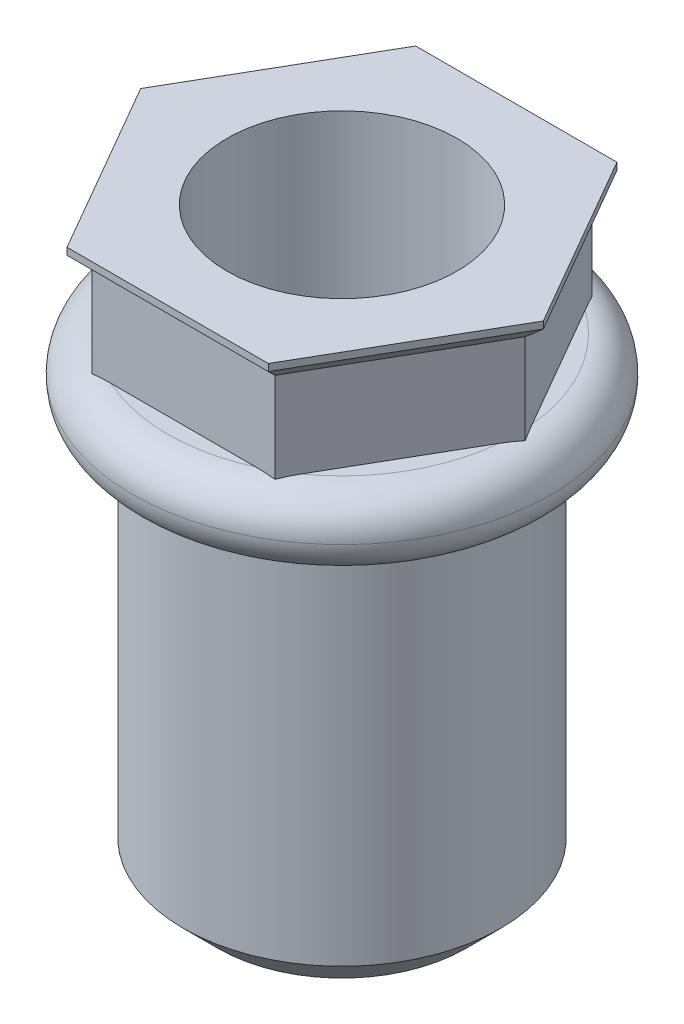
ISO-10303-21;
HEADER;
FILE_DESCRIPTION(('STEP AP214'),'2;1');
FILE_NAME('part.step','',(''),(''),'','','');
FILE_SCHEMA(('AUTOMOTIVE_DESIGN { 1 0 10303 214 1 1 1 1 }'));
ENDSEC;
DATA;
#1=APPLICATION_CONTEXT('core data for automotive mechanical design processes');
#2=APPLICATION_PROTOCOL_DEFINITION('international standard','automotive_design',2000,#1);
#3=PRODUCT_CONTEXT('',#1,'mechanical');
#4=PRODUCT('Part','Part','',(#3));
#5=PRODUCT_RELATED_PRODUCT_CATEGORY('part','',(#4));
#6=PRODUCT_DEFINITION_FORMATION('','',#4);
#7=PRODUCT_DEFINITION_CONTEXT('part definition',#1,'design');
#8=PRODUCT_DEFINITION('design','',#6,#7);
#9=PRODUCT_DEFINITION_SHAPE('','',#8);
#10=(LENGTH_UNIT() NAMED_UNIT(*) SI_UNIT(.MILLI.,.METRE.));
#11=(NAMED_UNIT(*) PLANE_ANGLE_UNIT() SI_UNIT($,.RADIAN.));
#12=(NAMED_UNIT(*) SI_UNIT($,.STERADIAN.) SOLID_ANGLE_UNIT());
#13=UNCERTAINTY_MEASURE_WITH_UNIT(LENGTH_MEASURE(1.E-05),#10,'distance_accuracy_value','');
#14=(GEOMETRIC_REPRESENTATION_CONTEXT(3) GLOBAL_UNCERTAINTY_ASSIGNED_CONTEXT((#13)) GLOBAL_UNIT_ASSIGNED_CONTEXT((#10,
#11,#12)) REPRESENTATION_CONTEXT('',''));
#15=CARTESIAN_POINT('',(0.,0.,0.));
#16=DIRECTION('',(0.,0.,1.));
#17=DIRECTION('',(1.,0.,0.));
#18=AXIS2_PLACEMENT_3D('',#15,#16,#17);
#19=CARTESIAN_POINT('',(0.,13.5,0.));
#20=DIRECTION('',(0.,1.,0.));
#21=DIRECTION('',(0.,0.,1.));
#22=AXIS2_PLACEMENT_3D('',#19,#20,#21);
#23=PLANE('',#22);
#24=CARTESIAN_POINT('',(0.,13.5,0.));
#25=DIRECTION('',(0.,1.,0.));
#26=DIRECTION('',(0.,0.,1.));
#27=AXIS2_PLACEMENT_3D('',#24,#25,#26);
#28=CIRCLE('',#27,5.);
#29=CARTESIAN_POINT('',(2.07304124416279,13.5,-4.55));
#30=VERTEX_POINT('',#29);
#31=CARTESIAN_POINT('',(-2.07304124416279,13.5,-4.55));
#32=VERTEX_POINT('',#31);
#33=EDGE_CURVE('E378',#30,#32,#28,.T.);
#34=ORIENTED_EDGE('',*,*,#33,.T.);
#35=DIRECTION('',(-1.,0.,0.));
#36=VECTOR('',#35,1.);
#37=CARTESIAN_POINT('',(-2.6269437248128,13.5000000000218,-4.55));
#38=LINE('',#37,#36);
#39=EDGE_CURVE('E321',#30,#32,#38,.T.);
#40=ORIENTED_EDGE('',*,*,#39,.F.);
#41=EDGE_LOOP('',(#34,#40));
#42=FACE_BOUND('',#41,.T.);
#43=ADVANCED_FACE('F37',(#42),#23,.T.);
#44=CARTESIAN_POINT('',(4.97693620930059,13.5,-0.479693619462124));
#45=VERTEX_POINT('',#44);
#46=CARTESIAN_POINT('',(2.9038949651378,13.5,-4.07030638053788));
#47=VERTEX_POINT('',#46);
#48=EDGE_CURVE('E429',#45,#47,#28,.T.);
#49=ORIENTED_EDGE('',*,*,#48,.T.);
#50=DIRECTION('',(-0.5,0.,-0.866025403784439));
#51=VECTOR('',#50,1.);
#52=CARTESIAN_POINT('',(2.6269437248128,13.5000000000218,-4.55));
#53=LINE('',#52,#51);
#54=EDGE_CURVE('E402',#45,#47,#53,.T.);
#55=ORIENTED_EDGE('',*,*,#54,.F.);
#56=EDGE_LOOP('',(#49,#55));
#57=FACE_BOUND('',#56,.T.);
#58=ADVANCED_FACE('F348',(#57),#23,.T.);
#59=CARTESIAN_POINT('',(2.9038949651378,13.5,4.07030638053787));
#60=VERTEX_POINT('',#59);
#61=CARTESIAN_POINT('',(4.97693620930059,13.5,0.479693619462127));
#62=VERTEX_POINT('',#61);
#63=EDGE_CURVE('E46',#60,#62,#28,.T.);
#64=ORIENTED_EDGE('',*,*,#63,.T.);
#65=DIRECTION('',(0.5,0.,-0.866025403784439));
#66=VECTOR('',#65,1.);
#67=CARTESIAN_POINT('',(5.2538874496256,13.5000000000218,0.));
#68=LINE('',#67,#66);
#69=EDGE_CURVE('E403',#60,#62,#68,.T.);
#70=ORIENTED_EDGE('',*,*,#69,.F.);
#71=EDGE_LOOP('',(#64,#70));
#72=FACE_BOUND('',#71,.T.);
#73=ADVANCED_FACE('F354',(#72),#23,.T.);
#74=CARTESIAN_POINT('',(-2.07304124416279,13.5,4.55));
#75=VERTEX_POINT('',#74);
#76=CARTESIAN_POINT('',(2.07304124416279,13.5,4.55));
#77=VERTEX_POINT('',#76);
#78=EDGE_CURVE('E375',#75,#77,#28,.T.);
#79=ORIENTED_EDGE('',*,*,#78,.T.);
#80=DIRECTION('',(1.,0.,0.));
#81=VECTOR('',#80,1.);
#82=CARTESIAN_POINT('',(2.6269437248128,13.5000000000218,4.55));
#83=LINE('',#82,#81);
#84=EDGE_CURVE('E280',#75,#77,#83,.T.);
#85=ORIENTED_EDGE('',*,*,#84,.F.);
#86=EDGE_LOOP('',(#79,#85));
#87=FACE_BOUND('',#86,.T.);
#88=ADVANCED_FACE('F367',(#87),#23,.T.);
#89=CARTESIAN_POINT('',(-2.9038949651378,13.5,-4.07030638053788));
#90=VERTEX_POINT('',#89);
#91=CARTESIAN_POINT('',(-4.97693620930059,13.5,-0.479693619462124));
#92=VERTEX_POINT('',#91);
#93=EDGE_CURVE('E374',#90,#92,#28,.T.);
#94=ORIENTED_EDGE('',*,*,#93,.T.);
#95=DIRECTION('',(-0.5,0.,0.866025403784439));
#96=VECTOR('',#95,1.);
#97=CARTESIAN_POINT('',(-5.25388744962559,13.5000000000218,0.));
#98=LINE('',#97,#96);
#99=EDGE_CURVE('E397',#90,#92,#98,.T.);
#100=ORIENTED_EDGE('',*,*,#99,.F.);
#101=EDGE_LOOP('',(#94,#100));
#102=FACE_BOUND('',#101,.T.);
#103=ADVANCED_FACE('F359',(#102),#23,.T.);
#104=CARTESIAN_POINT('',(-4.97693620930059,13.5,0.479693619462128));
#105=VERTEX_POINT('',#104);
#106=CARTESIAN_POINT('',(-2.90389496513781,13.5,4.07030638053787));
#107=VERTEX_POINT('',#106);
#108=EDGE_CURVE('E371',#105,#107,#28,.T.);
#109=ORIENTED_EDGE('',*,*,#108,.T.);
#110=DIRECTION('',(0.5,0.,0.866025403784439));
#111=VECTOR('',#110,1.);
#112=CARTESIAN_POINT('',(-2.6269437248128,13.5000000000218,4.55));
#113=LINE('',#112,#111);
#114=EDGE_CURVE('E271',#105,#107,#113,.T.);
#115=ORIENTED_EDGE('',*,*,#114,.F.);
#116=EDGE_LOOP('',(#109,#115));
#117=FACE_BOUND('',#116,.T.);
#118=ADVANCED_FACE('F350',(#117),#23,.T.);
#119=CARTESIAN_POINT('',(0.,12.5,0.));
#120=DIRECTION('',(0.,1.,0.));
#121=DIRECTION('',(0.,0.,1.));
#122=AXIS2_PLACEMENT_3D('',#119,#120,#121);
#123=TOROIDAL_SURFACE('',#122,5.,1.);
#124=CARTESIAN_POINT('',(0.,12.5,0.));
#125=DIRECTION('',(0.,1.,0.));
#126=DIRECTION('',(0.,0.,1.));
#127=AXIS2_PLACEMENT_3D('',#124,#125,#126);
#128=CIRCLE('',#127,6.);
#129=CARTESIAN_POINT('',(0.,12.5,6.));
#130=VERTEX_POINT('',#129);
#131=EDGE_CURVE('E41',#130,#130,#128,.T.);
#132=ORIENTED_EDGE('',*,*,#131,.T.);
#133=EDGE_LOOP('',(#132));
#134=FACE_BOUND('',#133,.T.);
#135=ORIENTED_EDGE('',*,*,#33,.F.);
#136=CARTESIAN_POINT('',(0.,13.3930285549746,-4.55));
#137=CARTESIAN_POINT('',(-0.0831839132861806,13.3930275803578,-4.55));
#138=CARTESIAN_POINT('',(-0.166367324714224,13.3941900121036,-4.55));
#139=CARTESIAN_POINT('',(-0.332671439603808,13.3986917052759,-4.55));
#140=CARTESIAN_POINT('',(-0.415792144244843,13.4020309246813,-4.55));
#141=CARTESIAN_POINT('',(-0.582047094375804,13.4104824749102,-4.55));
#142=CARTESIAN_POINT('',(-0.665181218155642,13.4155970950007,-4.55));
#143=CARTESIAN_POINT('',(-0.831373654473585,13.426978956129,-4.55));
#144=CARTESIAN_POINT('',(-0.91443196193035,13.4332462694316,-4.55));
#145=CARTESIAN_POINT('',(-1.16440643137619,13.4527309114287,-4.55));
#146=CARTESIAN_POINT('',(-1.33126550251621,13.4665727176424,-4.55));
#147=CARTESIAN_POINT('',(-1.66537813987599,13.4889809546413,-4.55));
#148=CARTESIAN_POINT('',(-1.8326315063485,13.4975496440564,-4.55));
#149=CARTESIAN_POINT('',(-2.08444994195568,13.5005664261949,-4.55));
#150=CARTESIAN_POINT('',(-2.16892919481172,13.4999070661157,-4.55));
#151=CARTESIAN_POINT('',(-2.33771995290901,13.4940934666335,-4.55));
#152=CARTESIAN_POINT('',(-2.4220315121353,13.4889410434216,-4.55));
#153=CARTESIAN_POINT('',(-2.58969064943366,13.4729018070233,-4.55));
#154=CARTESIAN_POINT('',(-2.67304096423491,13.462045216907,-4.55));
#155=CARTESIAN_POINT('',(-2.83845084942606,13.4331555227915,-4.55));
#156=CARTESIAN_POINT('',(-2.9205117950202,13.4151306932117,-4.55));
#157=CARTESIAN_POINT('',(-3.06881099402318,13.3738961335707,-4.55));
#158=CARTESIAN_POINT('',(-3.1354188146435,13.3520396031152,-4.55));
#159=CARTESIAN_POINT('',(-3.26593300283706,13.3008916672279,-4.55));
#160=CARTESIAN_POINT('',(-3.32983417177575,13.2715866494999,-4.55));
#161=CARTESIAN_POINT('',(-3.4537162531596,13.2038854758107,-4.55));
#162=CARTESIAN_POINT('',(-3.51364175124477,13.165385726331,-4.55));
#163=CARTESIAN_POINT('',(-3.62563448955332,13.0782816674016,-4.55));
#164=CARTESIAN_POINT('',(-3.67772921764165,13.0297141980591,-4.55));
#165=CARTESIAN_POINT('',(-3.75172824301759,12.9431077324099,-4.55));
#166=CARTESIAN_POINT('',(-3.77748049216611,12.9083568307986,-4.55));
#167=CARTESIAN_POINT('',(-3.82318196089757,12.8351909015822,-4.55));
#168=CARTESIAN_POINT('',(-3.84313435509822,12.7967778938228,-4.55));
#169=CARTESIAN_POINT('',(-3.87606340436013,12.71663035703,-4.55));
#170=CARTESIAN_POINT('',(-3.88897767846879,12.6748697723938,-4.55));
#171=CARTESIAN_POINT('',(-3.90644965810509,12.5896327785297,-4.55));
#172=CARTESIAN_POINT('',(-3.91101447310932,12.5461578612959,-4.55));
#173=CARTESIAN_POINT('',(-3.91135578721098,12.4645673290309,-4.55));
#174=CARTESIAN_POINT('',(-3.90814755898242,12.4264526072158,-4.55));
#175=CARTESIAN_POINT('',(-3.89524866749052,12.3513459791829,-4.55));
#176=CARTESIAN_POINT('',(-3.8855577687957,12.314354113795,-4.55));
#177=CARTESIAN_POINT('',(-3.86055105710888,12.2430207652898,-4.55));
#178=CARTESIAN_POINT('',(-3.845328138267,12.2086462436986,-4.55));
#179=CARTESIAN_POINT('',(-3.81007808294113,12.1424784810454,-4.55));
#180=CARTESIAN_POINT('',(-3.79004908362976,12.1106862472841,-4.55));
#181=CARTESIAN_POINT('',(-3.73536158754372,12.0352492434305,-4.55));
#182=CARTESIAN_POINT('',(-3.69831824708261,11.9933309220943,-4.55));
#183=CARTESIAN_POINT('',(-3.61800228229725,11.9159582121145,-4.55));
#184=CARTESIAN_POINT('',(-3.57471490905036,11.8805195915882,-4.55));
#185=CARTESIAN_POINT('',(-3.46093880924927,11.7993969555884,-4.55));
#186=CARTESIAN_POINT('',(-3.38773338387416,11.7575467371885,-4.55));
#187=CARTESIAN_POINT('',(-3.23590109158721,11.6854890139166,-4.55));
#188=CARTESIAN_POINT('',(-3.15726518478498,11.6553015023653,-4.55));
#189=CARTESIAN_POINT('',(-3.00522553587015,11.607063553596,-4.55));
#190=CARTESIAN_POINT('',(-2.93210597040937,11.5880893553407,-4.55));
#191=CARTESIAN_POINT('',(-2.78447411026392,11.5564869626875,-4.55));
#192=CARTESIAN_POINT('',(-2.70996057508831,11.5438647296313,-4.55));
#193=CARTESIAN_POINT('',(-2.56007404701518,11.523807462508,-4.55));
#194=CARTESIAN_POINT('',(-2.48469935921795,11.5163856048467,-4.55));
#195=CARTESIAN_POINT('',(-2.33363970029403,11.5057763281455,-4.55));
#196=CARTESIAN_POINT('',(-2.25795461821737,11.5025905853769,-4.55));
#197=CARTESIAN_POINT('',(-2.00789499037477,11.4975694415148,-4.55));
#198=CARTESIAN_POINT('',(-1.83340984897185,11.502900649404,-4.55));
#199=CARTESIAN_POINT('',(-1.48480555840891,11.5218860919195,-4.55));
#200=CARTESIAN_POINT('',(-1.31068750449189,11.5355541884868,-4.55));
#201=CARTESIAN_POINT('',(-1.04987138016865,11.5561839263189,-4.55));
#202=CARTESIAN_POINT('',(-0.963172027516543,11.5630673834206,-4.55));
#203=CARTESIAN_POINT('',(-0.789711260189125,11.575983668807,-4.55));
#204=CARTESIAN_POINT('',(-0.702949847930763,11.58201652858,-4.55));
#205=CARTESIAN_POINT('',(-0.529447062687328,11.5924348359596,-4.55));
#206=CARTESIAN_POINT('',(-0.442705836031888,11.5968226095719,-4.55));
#207=CARTESIAN_POINT('',(-0.269138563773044,11.6033812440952,-4.55));
#208=CARTESIAN_POINT('',(-0.182312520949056,11.6055521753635,-4.55));
#209=CARTESIAN_POINT('',(-0.00877452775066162,11.6073812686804,-4.55));
#210=CARTESIAN_POINT('',(0.0779373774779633,11.6070435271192,-4.55));
#211=CARTESIAN_POINT('',(0.251316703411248,11.6039112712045,-4.55));
#212=CARTESIAN_POINT('',(0.33798412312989,11.6011167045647,-4.55));
#213=CARTESIAN_POINT('',(0.511327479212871,11.59344106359,-4.55));
#214=CARTESIAN_POINT('',(0.598003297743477,11.5885574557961,-4.55));
#215=CARTESIAN_POINT('',(0.771263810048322,11.5773495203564,-4.55));
#216=CARTESIAN_POINT('',(0.857848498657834,11.5710251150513,-4.55));
#217=CARTESIAN_POINT('',(1.11860413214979,11.5510218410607,-4.55));
#218=CARTESIAN_POINT('',(1.29268905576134,11.5363803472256,-4.55));
#219=CARTESIAN_POINT('',(1.64113731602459,11.5123403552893,-4.55));
#220=CARTESIAN_POINT('',(1.81550008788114,11.5029357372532,-4.55));
#221=CARTESIAN_POINT('',(2.07810822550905,11.4993803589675,-4.55));
#222=CARTESIAN_POINT('',(2.16624967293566,11.4999827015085,-4.55));
#223=CARTESIAN_POINT('',(2.34244859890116,11.5060875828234,-4.55));
#224=CARTESIAN_POINT('',(2.43050597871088,11.5115934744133,-4.55));
#225=CARTESIAN_POINT('',(2.60542257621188,11.5289185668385,-4.55));
#226=CARTESIAN_POINT('',(2.69228586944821,11.540694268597,-4.55));
#227=CARTESIAN_POINT('',(2.86451232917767,11.5722048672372,-4.55));
#228=CARTESIAN_POINT('',(2.94987742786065,11.5919285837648,-4.55));
#229=CARTESIAN_POINT('',(3.09650890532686,11.6350893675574,-4.55));
#230=CARTESIAN_POINT('',(3.15841435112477,11.6563289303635,-4.55));
#231=CARTESIAN_POINT('',(3.2797371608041,11.7053914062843,-4.55));
#232=CARTESIAN_POINT('',(3.33915034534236,11.7332248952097,-4.55));
#233=CARTESIAN_POINT('',(3.45440217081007,11.7967982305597,-4.55));
#234=CARTESIAN_POINT('',(3.51020165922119,11.8326104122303,-4.55));
#235=CARTESIAN_POINT('',(3.61513014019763,11.9129650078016,-4.55));
#236=CARTESIAN_POINT('',(3.6642760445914,11.9574845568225,-4.55));
#237=CARTESIAN_POINT('',(3.7376961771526,12.0392474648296,-4.55));
#238=CARTESIAN_POINT('',(3.76479318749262,12.0739494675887,-4.55));
#239=CARTESIAN_POINT('',(3.81319659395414,12.1472214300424,-4.55));
#240=CARTESIAN_POINT('',(3.83450592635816,12.1857894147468,-4.55));
#241=CARTESIAN_POINT('',(3.87010346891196,12.2665229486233,-4.55));
#242=CARTESIAN_POINT('',(3.88432437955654,12.3087186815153,-4.55));
#243=CARTESIAN_POINT('',(3.90420368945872,12.3950836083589,-4.55));
#244=CARTESIAN_POINT('',(3.90987059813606,12.4392507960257,-4.55));
#245=CARTESIAN_POINT('',(3.91196758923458,12.5219204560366,-4.55));
#246=CARTESIAN_POINT('',(3.9095221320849,12.5603980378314,-4.55));
#247=CARTESIAN_POINT('',(3.89799359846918,12.6363368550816,-4.55));
#248=CARTESIAN_POINT('',(3.88891049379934,12.6737980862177,-4.55));
#249=CARTESIAN_POINT('',(3.86507416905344,12.7456920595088,-4.55));
#250=CARTESIAN_POINT('',(3.85048445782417,12.780179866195,-4.55));
#251=CARTESIAN_POINT('',(3.81644356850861,12.8466436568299,-4.55));
#252=CARTESIAN_POINT('',(3.79699064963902,12.8786187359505,-4.55));
#253=CARTESIAN_POINT('',(3.74402012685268,12.9540434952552,-4.55));
#254=CARTESIAN_POINT('',(3.70817997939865,12.9958641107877,-4.55));
#255=CARTESIAN_POINT('',(3.63025926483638,13.0732229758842,-4.55));
#256=CARTESIAN_POINT('',(3.58816408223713,13.1087460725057,-4.55));
#257=CARTESIAN_POINT('',(3.47774912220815,13.1899271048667,-4.55));
#258=CARTESIAN_POINT('',(3.40674979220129,13.2319184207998,-4.55));
#259=CARTESIAN_POINT('',(3.25926820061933,13.3045582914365,-4.55));
#260=CARTESIAN_POINT('',(3.18277708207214,13.3351880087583,-4.55));
#261=CARTESIAN_POINT('',(3.0354885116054,13.3841911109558,-4.55));
#262=CARTESIAN_POINT('',(2.9650097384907,13.4035515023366,-4.55));
#263=CARTESIAN_POINT('',(2.82261482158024,13.4361429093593,-4.55));
#264=CARTESIAN_POINT('',(2.75069740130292,13.4493682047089,-4.55));
#265=CARTESIAN_POINT('',(2.60595526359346,13.4707680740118,-4.55));
#266=CARTESIAN_POINT('',(2.53312871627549,13.4789298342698,-4.55));
#267=CARTESIAN_POINT('',(2.38712227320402,13.4910905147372,-4.55));
#268=CARTESIAN_POINT('',(2.31394226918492,13.4950880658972,-4.55));
#269=CARTESIAN_POINT('',(2.14718339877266,13.5003939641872,-4.55));
#270=CARTESIAN_POINT('',(2.05357414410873,13.5006494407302,-4.55));
#271=CARTESIAN_POINT('',(1.86644734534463,13.4972522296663,-4.55));
#272=CARTESIAN_POINT('',(1.77292980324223,13.4935994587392,-4.55));
#273=CARTESIAN_POINT('',(1.49224105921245,13.4788719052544,-4.55));
#274=CARTESIAN_POINT('',(1.3052938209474,13.4640274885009,-4.55));
#275=CARTESIAN_POINT('',(1.02522994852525,13.4418629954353,-4.55));
#276=CARTESIAN_POINT('',(0.932096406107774,13.4345045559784,-4.55));
#277=CARTESIAN_POINT('',(0.745748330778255,13.4209114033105,-4.55));
#278=CARTESIAN_POINT('',(0.652533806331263,13.4146765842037,-4.55));
#279=CARTESIAN_POINT('',(0.46614094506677,13.4042823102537,-4.55));
#280=CARTESIAN_POINT('',(0.372962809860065,13.4001193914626,-4.55));
#281=CARTESIAN_POINT('',(0.186522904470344,13.3944930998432,-4.55));
#282=CARTESIAN_POINT('',(0.0932611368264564,13.3930296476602,-4.55));
#283=CARTESIAN_POINT('',(0.,13.3930285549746,-4.55));
#284=B_SPLINE_CURVE_WITH_KNOTS('',3,(#136,#137,#138,#139,#140,#141,#142,#143,#144,#145,#146,
#147,#148,#149,#150,#151,#152,#153,#154,#155,#156,#157,#158,#159,#160,#161,#162,#163,#164,#165,
#166,#167,#168,#169,#170,#171,#172,#173,#174,#175,#176,#177,#178,#179,#180,#181,#182,#183,#184,
#185,#186,#187,#188,#189,#190,#191,#192,#193,#194,#195,#196,#197,#198,#199,#200,#201,#202,#203,
#204,#205,#206,#207,#208,#209,#210,#211,#212,#213,#214,#215,#216,#217,#218,#219,#220,#221,#222,
#223,#224,#225,#226,#227,#228,#229,#230,#231,#232,#233,#234,#235,#236,#237,#238,#239,#240,#241,
#242,#243,#244,#245,#246,#247,#248,#249,#250,#251,#252,#253,#254,#255,#256,#257,#258,#259,#260,
#261,#262,#263,#264,#265,#266,#267,#268,#269,#270,#271,#272,#273,#274,#275,#276,#277,#278,#279,
#280,#281,#282,#283),.UNSPECIFIED.,.T.,.F.,(4,2,2,2,2,2,2,2,2,2,2,2,2,2,2,2,2,2,2,2,2,2,2,2,2,2,
2,2,2,2,2,2,2,2,2,2,2,2,2,2,2,2,2,2,2,2,2,2,2,2,2,2,2,2,2,2,2,2,2,2,2,2,2,2,2,2,2,2,2,2,2,2,2,
4),(0.,0.24954351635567,0.49908221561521,0.748943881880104,0.998821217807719,1.50115129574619,
2.00326606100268,2.25662057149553,2.509872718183,2.76179636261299,3.01343004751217,
3.2233869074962,3.43373026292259,3.64656565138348,3.8586355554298,3.98794327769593,
4.1171800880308,4.2475444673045,4.3777977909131,4.49197266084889,4.6061516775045,
4.71849585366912,4.83088364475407,4.99775938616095,5.16503596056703,5.4165903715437,
5.66857412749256,5.89486184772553,6.12136154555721,6.34843307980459,6.57559444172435,
7.09870777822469,7.62269328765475,7.8836074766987,8.14451200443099,8.40504623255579,
8.6655721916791,8.92567283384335,9.18577901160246,9.44620152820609,9.70663808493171,
10.2307793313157,10.7543067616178,11.0186348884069,11.2831438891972,11.5458412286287,
11.8081703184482,12.0042157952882,12.2005778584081,12.3987983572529,12.5965051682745,
12.7281323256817,12.8596925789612,12.9924791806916,13.1251336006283,13.2402100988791,
13.3552870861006,13.4671861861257,13.5791253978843,13.7434270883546,13.9081189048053,
14.1541969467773,14.400681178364,14.6196268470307,14.8387762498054,15.0584779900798,
15.2782519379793,15.5589585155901,15.8396710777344,16.4021744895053,16.6824534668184,
16.9627060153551,17.2424884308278,17.5222626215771),.UNSPECIFIED.);
#285=CARTESIAN_POINT('',(2.6269437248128,13.4672337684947,-4.55));
#286=VERTEX_POINT('',#285);
#287=EDGE_CURVE('E399',#286,#30,#284,.T.);
#288=ORIENTED_EDGE('',*,*,#287,.F.);
#289=CARTESIAN_POINT('',(5.25400291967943,13.4672034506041,0.000200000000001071));
#290=CARTESIAN_POINT('',(5.21679276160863,13.4769515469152,-0.0642498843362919));
#291=CARTESIAN_POINT('',(5.17944639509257,13.4841799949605,-0.128935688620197));
#292=CARTESIAN_POINT('',(5.104653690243,13.4944784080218,-0.258480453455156));
#293=CARTESIAN_POINT('',(5.06720753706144,13.4975535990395,-0.323339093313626));
#294=CARTESIAN_POINT('',(4.99245311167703,13.5004402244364,-0.452817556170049));
#295=CARTESIAN_POINT('',(4.95514493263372,13.5002655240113,-0.517437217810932));
#296=CARTESIAN_POINT('',(4.8805419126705,13.4974451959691,-0.646653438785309));
#297=CARTESIAN_POINT('',(4.84324708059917,13.494798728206,-0.7112499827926));
#298=CARTESIAN_POINT('',(4.73156469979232,13.4842401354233,-0.904689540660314));
#299=CARTESIAN_POINT('',(4.65724568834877,13.4737087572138,-1.03341384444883));
#300=CARTESIAN_POINT('',(4.50861571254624,13.4508749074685,-1.29084851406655));
#301=CARTESIAN_POINT('',(4.43430483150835,13.4385706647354,-1.41955873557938));
#302=CARTESIAN_POINT('',(4.30368194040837,13.4195064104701,-1.64580421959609));
#303=CARTESIAN_POINT('',(4.24739509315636,13.41212597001,-1.74329589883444));
#304=CARTESIAN_POINT('',(4.13475531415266,13.4006319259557,-1.93839371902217));
#305=CARTESIAN_POINT('',(4.07840241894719,13.396516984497,-2.03599979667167));
#306=CARTESIAN_POINT('',(3.96565030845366,13.3924776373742,-2.23129218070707));
#307=CARTESIAN_POINT('',(3.90925108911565,13.3925536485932,-2.32897849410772));
#308=CARTESIAN_POINT('',(3.79648217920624,13.3968817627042,-2.52429997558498));
#309=CARTESIAN_POINT('',(3.74011249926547,13.4011348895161,-2.62193512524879));
#310=CARTESIAN_POINT('',(3.63985259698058,13.4115647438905,-2.79559036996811));
#311=CARTESIAN_POINT('',(3.59594476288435,13.4171125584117,-2.87164096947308));
#312=CARTESIAN_POINT('',(3.50817226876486,13.4294030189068,-3.02366738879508));
#313=CARTESIAN_POINT('',(3.46430760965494,13.4361456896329,-3.09964320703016));
#314=CARTESIAN_POINT('',(3.33278258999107,13.4568295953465,-3.32745122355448));
#315=CARTESIAN_POINT('',(3.24513714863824,13.4712344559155,-3.47925758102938));
#316=CARTESIAN_POINT('',(3.11327484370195,13.4876566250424,-3.70764979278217));
#317=CARTESIAN_POINT('',(3.06914742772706,13.4922713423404,-3.7840807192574));
#318=CARTESIAN_POINT('',(2.9808580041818,13.4985934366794,-3.93700248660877));
#319=CARTESIAN_POINT('',(2.93669602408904,13.5003022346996,-4.01349327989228));
#320=CARTESIAN_POINT('',(2.8481749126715,13.4996066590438,-4.16681634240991));
#321=CARTESIAN_POINT('',(2.80381574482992,13.4971846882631,-4.24364867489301));
#322=CARTESIAN_POINT('',(2.71518800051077,13.4867553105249,-4.39715643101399));
#323=CARTESIAN_POINT('',(2.67091973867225,13.4787376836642,-4.47383130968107));
#324=CARTESIAN_POINT('',(2.62682825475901,13.4672034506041,-4.55019999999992));
#325=B_SPLINE_CURVE_WITH_KNOTS('',3,(#289,#290,#291,#292,#293,#294,#295,#296,#297,#298,#299,
#300,#301,#302,#303,#304,#305,#306,#307,#308,#309,#310,#311,#312,#313,#314,#315,#316,#317,#318,
#319,#320,#321,#322,#323,#324),.UNSPECIFIED.,.F.,.F.,(4,2,2,2,2,2,2,2,2,2,2,2,2,2,2,2,2,4),(0.,
0.225043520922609,0.449803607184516,0.673605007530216,0.897482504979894,1.34443711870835,
1.79184140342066,2.13025778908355,2.46853545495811,2.80684677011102,3.14524103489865,
3.40920019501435,3.67316482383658,4.20076900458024,4.46586153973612,4.73082440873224,
4.99691884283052,5.26350054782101),.UNSPECIFIED.);
#326=EDGE_CURVE('E322',#47,#286,#325,.T.);
#327=ORIENTED_EDGE('',*,*,#326,.F.);
#328=ORIENTED_EDGE('',*,*,#48,.F.);
#329=CARTESIAN_POINT('',(5.2538874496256,13.4672337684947,0.));
#330=VERTEX_POINT('',#329);
#331=EDGE_CURVE('E316',#330,#45,#325,.T.);
#332=ORIENTED_EDGE('',*,*,#331,.F.);
#333=CARTESIAN_POINT('',(2.626828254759,13.4672034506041,4.55019999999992));
#334=CARTESIAN_POINT('',(2.66403841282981,13.4769515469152,4.48575011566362));
#335=CARTESIAN_POINT('',(2.70138477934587,13.4841799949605,4.42106431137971));
#336=CARTESIAN_POINT('',(2.77617748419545,13.4944784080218,4.29151954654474));
#337=CARTESIAN_POINT('',(2.81362363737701,13.4975535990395,4.22666090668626));
#338=CARTESIAN_POINT('',(2.88837806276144,13.5004402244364,4.09718244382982));
#339=CARTESIAN_POINT('',(2.92568624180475,13.5002655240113,4.03256278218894));
#340=CARTESIAN_POINT('',(3.00028926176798,13.4974451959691,3.90334656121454));
#341=CARTESIAN_POINT('',(3.03758409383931,13.4947987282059,3.83875001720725));
#342=CARTESIAN_POINT('',(3.14926647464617,13.4842401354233,3.64531045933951));
#343=CARTESIAN_POINT('',(3.22358548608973,13.4737087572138,3.51658615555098));
#344=CARTESIAN_POINT('',(3.37221546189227,13.4508749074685,3.25915148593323));
#345=CARTESIAN_POINT('',(3.44652634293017,13.4385706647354,3.13044126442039));
#346=CARTESIAN_POINT('',(3.57714923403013,13.4195064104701,2.90419578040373));
#347=CARTESIAN_POINT('',(3.6334360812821,13.41212597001,2.80670410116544));
#348=CARTESIAN_POINT('',(3.74607586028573,13.4006319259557,2.61160628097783));
#349=CARTESIAN_POINT('',(3.80242875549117,13.396516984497,2.5140002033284));
#350=CARTESIAN_POINT('',(3.91518086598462,13.3924776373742,2.31870781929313));
#351=CARTESIAN_POINT('',(3.97158008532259,13.3925536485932,2.22102150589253));
#352=CARTESIAN_POINT('',(4.08434899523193,13.3968817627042,2.02570002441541));
#353=CARTESIAN_POINT('',(4.14071867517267,13.4011348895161,1.92806487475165));
#354=CARTESIAN_POINT('',(4.24097857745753,13.4115647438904,1.75440963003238));
#355=CARTESIAN_POINT('',(4.28488641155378,13.4171125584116,1.67835903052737));
#356=CARTESIAN_POINT('',(4.37265890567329,13.4294030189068,1.52633261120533));
#357=CARTESIAN_POINT('',(4.41652356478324,13.4361456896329,1.45035679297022));
#358=CARTESIAN_POINT('',(4.54804858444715,13.4568295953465,1.22254877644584));
#359=CARTESIAN_POINT('',(4.6356940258,13.4712344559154,1.07074241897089));
#360=CARTESIAN_POINT('',(4.76755633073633,13.4876566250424,0.842350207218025));
#361=CARTESIAN_POINT('',(4.81168374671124,13.4922713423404,0.765919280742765));
#362=CARTESIAN_POINT('',(4.89997317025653,13.4985934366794,0.612997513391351));
#363=CARTESIAN_POINT('',(4.9441351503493,13.5003022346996,0.536506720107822));
#364=CARTESIAN_POINT('',(5.03265626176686,13.4996066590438,0.383183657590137));
#365=CARTESIAN_POINT('',(5.07701542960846,13.4971846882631,0.30635132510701));
#366=CARTESIAN_POINT('',(5.16564317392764,13.4867553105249,0.152843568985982));
#367=CARTESIAN_POINT('',(5.20991143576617,13.4787376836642,0.0761686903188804));
#368=CARTESIAN_POINT('',(5.25400291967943,13.4672034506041,-0.000199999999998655));
#369=B_SPLINE_CURVE_WITH_KNOTS('',3,(#333,#334,#335,#336,#337,#338,#339,#340,#341,#342,#343,
#344,#345,#346,#347,#348,#349,#350,#351,#352,#353,#354,#355,#356,#357,#358,#359,#360,#361,#362,
#363,#364,#365,#366,#367,#368),.UNSPECIFIED.,.F.,.F.,(4,2,2,2,2,2,2,2,2,2,2,2,2,2,2,2,2,4),(0.,
0.225043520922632,0.449803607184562,0.673605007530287,0.897482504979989,1.34443711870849,
1.79184140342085,2.13025778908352,2.46853545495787,2.80684677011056,3.14524103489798,
3.40920019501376,3.67316482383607,4.2007690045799,4.46586153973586,4.73082440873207,
4.99691884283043,5.26350054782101),.UNSPECIFIED.);
#370=EDGE_CURVE('E404',#62,#330,#369,.T.);
#371=ORIENTED_EDGE('',*,*,#370,.F.);
#372=ORIENTED_EDGE('',*,*,#63,.F.);
#373=CARTESIAN_POINT('',(2.6269437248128,13.4672337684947,4.55));
#374=VERTEX_POINT('',#373);
#375=EDGE_CURVE('E310',#374,#60,#369,.T.);
#376=ORIENTED_EDGE('',*,*,#375,.F.);
#377=CARTESIAN_POINT('',(0.,13.3930285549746,4.55));
#378=CARTESIAN_POINT('',(0.0831839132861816,13.3930275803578,4.55));
#379=CARTESIAN_POINT('',(0.166367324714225,13.3941900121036,4.55));
#380=CARTESIAN_POINT('',(0.332671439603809,13.3986917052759,4.55));
#381=CARTESIAN_POINT('',(0.415792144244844,13.4020309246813,4.55));
#382=CARTESIAN_POINT('',(0.582047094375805,13.4104824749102,4.55));
#383=CARTESIAN_POINT('',(0.665181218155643,13.4155970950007,4.55));
#384=CARTESIAN_POINT('',(0.831373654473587,13.426978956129,4.55));
#385=CARTESIAN_POINT('',(0.914431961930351,13.4332462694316,4.55));
#386=CARTESIAN_POINT('',(1.16440643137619,13.4527309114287,4.55));
#387=CARTESIAN_POINT('',(1.33126550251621,13.4665727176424,4.55));
#388=CARTESIAN_POINT('',(1.66537813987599,13.4889809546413,4.55));
#389=CARTESIAN_POINT('',(1.8326315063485,13.4975496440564,4.55));
#390=CARTESIAN_POINT('',(2.08444994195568,13.5005664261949,4.55));
#391=CARTESIAN_POINT('',(2.16892919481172,13.4999070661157,4.55));
#392=CARTESIAN_POINT('',(2.33771995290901,13.4940934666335,4.55));
#393=CARTESIAN_POINT('',(2.42203151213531,13.4889410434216,4.55));
#394=CARTESIAN_POINT('',(2.58969064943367,13.4729018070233,4.55));
#395=CARTESIAN_POINT('',(2.67304096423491,13.462045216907,4.55));
#396=CARTESIAN_POINT('',(2.83845084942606,13.4331555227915,4.55));
#397=CARTESIAN_POINT('',(2.9205117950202,13.4151306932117,4.55));
#398=CARTESIAN_POINT('',(3.06881099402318,13.3738961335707,4.55));
#399=CARTESIAN_POINT('',(3.1354188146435,13.3520396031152,4.55));
#400=CARTESIAN_POINT('',(3.26593300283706,13.3008916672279,4.55));
#401=CARTESIAN_POINT('',(3.32983417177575,13.2715866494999,4.55));
#402=CARTESIAN_POINT('',(3.4537162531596,13.2038854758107,4.55));
#403=CARTESIAN_POINT('',(3.51364175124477,13.165385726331,4.55));
#404=CARTESIAN_POINT('',(3.62563448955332,13.0782816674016,4.55));
#405=CARTESIAN_POINT('',(3.67772921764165,13.0297141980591,4.55));
#406=CARTESIAN_POINT('',(3.75172824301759,12.9431077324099,4.55));
#407=CARTESIAN_POINT('',(3.7774804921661,12.9083568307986,4.55));
#408=CARTESIAN_POINT('',(3.82318196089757,12.8351909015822,4.55));
#409=CARTESIAN_POINT('',(3.84313435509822,12.7967778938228,4.55));
#410=CARTESIAN_POINT('',(3.87606340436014,12.71663035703,4.55));
#411=CARTESIAN_POINT('',(3.88897767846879,12.6748697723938,4.55));
#412=CARTESIAN_POINT('',(3.90644965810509,12.5896327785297,4.55));
#413=CARTESIAN_POINT('',(3.91101447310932,12.5461578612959,4.55));
#414=CARTESIAN_POINT('',(3.91135578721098,12.4645673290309,4.55));
#415=CARTESIAN_POINT('',(3.90814755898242,12.4264526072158,4.55));
#416=CARTESIAN_POINT('',(3.89524866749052,12.3513459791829,4.55));
#417=CARTESIAN_POINT('',(3.8855577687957,12.314354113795,4.55));
#418=CARTESIAN_POINT('',(3.86055105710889,12.2430207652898,4.55));
#419=CARTESIAN_POINT('',(3.845328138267,12.2086462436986,4.55));
#420=CARTESIAN_POINT('',(3.81007808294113,12.1424784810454,4.55));
#421=CARTESIAN_POINT('',(3.79004908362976,12.1106862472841,4.55));
#422=CARTESIAN_POINT('',(3.73536158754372,12.0352492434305,4.55));
#423=CARTESIAN_POINT('',(3.69831824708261,11.9933309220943,4.55));
#424=CARTESIAN_POINT('',(3.61800228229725,11.9159582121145,4.55));
#425=CARTESIAN_POINT('',(3.57471490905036,11.8805195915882,4.55));
#426=CARTESIAN_POINT('',(3.46093880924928,11.7993969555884,4.55));
#427=CARTESIAN_POINT('',(3.38773338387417,11.7575467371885,4.55));
#428=CARTESIAN_POINT('',(3.23590109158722,11.6854890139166,4.55));
#429=CARTESIAN_POINT('',(3.15726518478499,11.6553015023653,4.55));
#430=CARTESIAN_POINT('',(3.00522553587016,11.607063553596,4.55));
#431=CARTESIAN_POINT('',(2.93210597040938,11.5880893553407,4.55));
#432=CARTESIAN_POINT('',(2.78447411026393,11.5564869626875,4.55));
#433=CARTESIAN_POINT('',(2.70996057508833,11.5438647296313,4.55));
#434=CARTESIAN_POINT('',(2.5600740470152,11.523807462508,4.55));
#435=CARTESIAN_POINT('',(2.48469935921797,11.5163856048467,4.55));
#436=CARTESIAN_POINT('',(2.33363970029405,11.5057763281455,4.55));
#437=CARTESIAN_POINT('',(2.2579546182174,11.5025905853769,4.55));
#438=CARTESIAN_POINT('',(2.0078949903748,11.4975694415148,4.55));
#439=CARTESIAN_POINT('',(1.83340984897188,11.502900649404,4.55));
#440=CARTESIAN_POINT('',(1.48480555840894,11.5218860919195,4.55));
#441=CARTESIAN_POINT('',(1.31068750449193,11.5355541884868,4.55));
#442=CARTESIAN_POINT('',(1.04987138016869,11.5561839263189,4.55));
#443=CARTESIAN_POINT('',(0.963172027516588,11.5630673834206,4.55));
#444=CARTESIAN_POINT('',(0.789711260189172,11.575983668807,4.55));
#445=CARTESIAN_POINT('',(0.702949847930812,11.58201652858,4.55));
#446=CARTESIAN_POINT('',(0.52944706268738,11.5924348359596,4.55));
#447=CARTESIAN_POINT('',(0.442705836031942,11.5968226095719,4.55));
#448=CARTESIAN_POINT('',(0.269138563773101,11.6033812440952,4.55));
#449=CARTESIAN_POINT('',(0.182312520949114,11.6055521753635,4.55));
#450=CARTESIAN_POINT('',(0.00877452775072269,11.6073812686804,4.55));
#451=CARTESIAN_POINT('',(-0.0779373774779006,11.6070435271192,4.55));
#452=CARTESIAN_POINT('',(-0.251316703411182,11.6039112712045,4.55));
#453=CARTESIAN_POINT('',(-0.337984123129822,11.6011167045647,4.55));
#454=CARTESIAN_POINT('',(-0.5113274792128,11.59344106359,4.55));
#455=CARTESIAN_POINT('',(-0.598003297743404,11.5885574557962,4.55));
#456=CARTESIAN_POINT('',(-0.771263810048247,11.5773495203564,4.55));
#457=CARTESIAN_POINT('',(-0.857848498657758,11.5710251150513,4.55));
#458=CARTESIAN_POINT('',(-1.11860413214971,11.5510218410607,4.55));
#459=CARTESIAN_POINT('',(-1.29268905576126,11.5363803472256,4.55));
#460=CARTESIAN_POINT('',(-1.64113731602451,11.5123403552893,4.55));
#461=CARTESIAN_POINT('',(-1.81550008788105,11.5029357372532,4.55));
#462=CARTESIAN_POINT('',(-2.07810822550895,11.4993803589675,4.55));
#463=CARTESIAN_POINT('',(-2.16624967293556,11.4999827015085,4.55));
#464=CARTESIAN_POINT('',(-2.34244859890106,11.5060875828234,4.55));
#465=CARTESIAN_POINT('',(-2.43050597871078,11.5115934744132,4.55));
#466=CARTESIAN_POINT('',(-2.60542257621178,11.5289185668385,4.55));
#467=CARTESIAN_POINT('',(-2.6922858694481,11.540694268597,4.55));
#468=CARTESIAN_POINT('',(-2.86451232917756,11.5722048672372,4.55));
#469=CARTESIAN_POINT('',(-2.94987742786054,11.5919285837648,4.55));
#470=CARTESIAN_POINT('',(-3.09650890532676,11.6350893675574,4.55));
#471=CARTESIAN_POINT('',(-3.15841435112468,11.6563289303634,4.55));
#472=CARTESIAN_POINT('',(-3.27973716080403,11.7053914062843,4.55));
#473=CARTESIAN_POINT('',(-3.3391503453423,11.7332248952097,4.55));
#474=CARTESIAN_POINT('',(-3.45440217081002,11.7967982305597,4.55));
#475=CARTESIAN_POINT('',(-3.51020165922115,11.8326104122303,4.55));
#476=CARTESIAN_POINT('',(-3.61513014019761,11.9129650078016,4.55));
#477=CARTESIAN_POINT('',(-3.66427604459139,11.9574845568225,4.55));
#478=CARTESIAN_POINT('',(-3.73769617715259,12.0392474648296,4.55));
#479=CARTESIAN_POINT('',(-3.76479318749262,12.0739494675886,4.55));
#480=CARTESIAN_POINT('',(-3.81319659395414,12.1472214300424,4.55));
#481=CARTESIAN_POINT('',(-3.83450592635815,12.1857894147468,4.55));
#482=CARTESIAN_POINT('',(-3.87010346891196,12.2665229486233,4.55));
#483=CARTESIAN_POINT('',(-3.88432437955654,12.3087186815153,4.55));
#484=CARTESIAN_POINT('',(-3.90420368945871,12.3950836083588,4.55));
#485=CARTESIAN_POINT('',(-3.90987059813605,12.4392507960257,4.55));
#486=CARTESIAN_POINT('',(-3.91196758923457,12.5219204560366,4.55));
#487=CARTESIAN_POINT('',(-3.90952213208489,12.5603980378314,4.55));
#488=CARTESIAN_POINT('',(-3.89799359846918,12.6363368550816,4.55));
#489=CARTESIAN_POINT('',(-3.88891049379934,12.6737980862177,4.55));
#490=CARTESIAN_POINT('',(-3.86507416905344,12.7456920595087,4.55));
#491=CARTESIAN_POINT('',(-3.85048445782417,12.780179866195,4.55));
#492=CARTESIAN_POINT('',(-3.8164435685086,12.8466436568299,4.55));
#493=CARTESIAN_POINT('',(-3.79699064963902,12.8786187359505,4.55));
#494=CARTESIAN_POINT('',(-3.74402012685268,12.9540434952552,4.55));
#495=CARTESIAN_POINT('',(-3.70817997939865,12.9958641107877,4.55));
#496=CARTESIAN_POINT('',(-3.63025926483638,13.0732229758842,4.55));
#497=CARTESIAN_POINT('',(-3.58816408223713,13.1087460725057,4.55));
#498=CARTESIAN_POINT('',(-3.47774912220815,13.1899271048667,4.55));
#499=CARTESIAN_POINT('',(-3.40674979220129,13.2319184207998,4.55));
#500=CARTESIAN_POINT('',(-3.25926820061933,13.3045582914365,4.55));
#501=CARTESIAN_POINT('',(-3.18277708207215,13.3351880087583,4.55));
#502=CARTESIAN_POINT('',(-3.03548851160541,13.3841911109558,4.55));
#503=CARTESIAN_POINT('',(-2.9650097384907,13.4035515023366,4.55));
#504=CARTESIAN_POINT('',(-2.82261482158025,13.4361429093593,4.55));
#505=CARTESIAN_POINT('',(-2.75069740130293,13.4493682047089,4.55));
#506=CARTESIAN_POINT('',(-2.60595526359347,13.4707680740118,4.55));
#507=CARTESIAN_POINT('',(-2.5331287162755,13.4789298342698,4.55));
#508=CARTESIAN_POINT('',(-2.38712227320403,13.4910905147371,4.55));
#509=CARTESIAN_POINT('',(-2.31394226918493,13.4950880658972,4.55));
#510=CARTESIAN_POINT('',(-2.14718339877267,13.5003939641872,4.55));
#511=CARTESIAN_POINT('',(-2.05357414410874,13.5006494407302,4.55));
#512=CARTESIAN_POINT('',(-1.86644734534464,13.4972522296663,4.55));
#513=CARTESIAN_POINT('',(-1.77292980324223,13.4935994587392,4.55));
#514=CARTESIAN_POINT('',(-1.49224105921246,13.4788719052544,4.55));
#515=CARTESIAN_POINT('',(-1.30529382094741,13.4640274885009,4.55));
#516=CARTESIAN_POINT('',(-1.02522994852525,13.4418629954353,4.55));
#517=CARTESIAN_POINT('',(-0.932096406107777,13.4345045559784,4.55));
#518=CARTESIAN_POINT('',(-0.745748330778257,13.4209114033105,4.55));
#519=CARTESIAN_POINT('',(-0.652533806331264,13.4146765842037,4.55));
#520=CARTESIAN_POINT('',(-0.466140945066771,13.4042823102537,4.55));
#521=CARTESIAN_POINT('',(-0.372962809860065,13.4001193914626,4.55));
#522=CARTESIAN_POINT('',(-0.186522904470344,13.3944930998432,4.55));
#523=CARTESIAN_POINT('',(-0.0932611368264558,13.3930296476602,4.55));
#524=CARTESIAN_POINT('',(0.,13.3930285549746,4.55));
#525=B_SPLINE_CURVE_WITH_KNOTS('',3,(#377,#378,#379,#380,#381,#382,#383,#384,#385,#386,#387,
#388,#389,#390,#391,#392,#393,#394,#395,#396,#397,#398,#399,#400,#401,#402,#403,#404,#405,#406,
#407,#408,#409,#410,#411,#412,#413,#414,#415,#416,#417,#418,#419,#420,#421,#422,#423,#424,#425,
#426,#427,#428,#429,#430,#431,#432,#433,#434,#435,#436,#437,#438,#439,#440,#441,#442,#443,#444,
#445,#446,#447,#448,#449,#450,#451,#452,#453,#454,#455,#456,#457,#458,#459,#460,#461,#462,#463,
#464,#465,#466,#467,#468,#469,#470,#471,#472,#473,#474,#475,#476,#477,#478,#479,#480,#481,#482,
#483,#484,#485,#486,#487,#488,#489,#490,#491,#492,#493,#494,#495,#496,#497,#498,#499,#500,#501,
#502,#503,#504,#505,#506,#507,#508,#509,#510,#511,#512,#513,#514,#515,#516,#517,#518,#519,#520,
#521,#522,#523,#524),.UNSPECIFIED.,.T.,.F.,(4,2,2,2,2,2,2,2,2,2,2,2,2,2,2,2,2,2,2,2,2,2,2,2,2,2,
2,2,2,2,2,2,2,2,2,2,2,2,2,2,2,2,2,2,2,2,2,2,2,2,2,2,2,2,2,2,2,2,2,2,2,2,2,2,2,2,2,2,2,2,2,2,2,
4),(0.,0.24954351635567,0.49908221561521,0.748943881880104,0.998821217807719,1.50115129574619,
2.00326606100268,2.25662057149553,2.509872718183,2.76179636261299,3.01343004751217,
3.2233869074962,3.43373026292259,3.64656565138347,3.85863555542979,3.98794327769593,
4.1171800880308,4.24754446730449,4.3777977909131,4.49197266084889,4.60615167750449,
4.71849585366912,4.83088364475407,4.99775938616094,5.16503596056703,5.41659037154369,
5.66857412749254,5.89486184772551,6.12136154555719,6.34843307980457,6.57559444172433,
7.09870777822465,7.62269328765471,7.88360747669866,8.14451200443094,8.40504623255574,
8.66557219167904,8.92567283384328,9.18577901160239,9.44620152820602,9.70663808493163,
10.2307793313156,10.7543067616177,11.0186348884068,11.2831438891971,11.5458412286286,
11.8081703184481,12.0042157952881,12.200577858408,12.3987983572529,12.5965051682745,
12.7281323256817,12.8596925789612,12.9924791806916,13.1251336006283,13.2402100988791,
13.3552870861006,13.4671861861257,13.5791253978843,13.7434270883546,13.9081189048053,
14.1541969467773,14.400681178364,14.6196268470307,14.8387762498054,15.0584779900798,
15.2782519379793,15.5589585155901,15.8396710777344,16.4021744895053,16.6824534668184,
16.9627060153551,17.2424884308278,17.5222626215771),.UNSPECIFIED.);
#526=EDGE_CURVE('E299',#77,#374,#525,.T.);
#527=ORIENTED_EDGE('',*,*,#526,.F.);
#528=ORIENTED_EDGE('',*,*,#78,.F.);
#529=CARTESIAN_POINT('',(-2.6269437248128,13.4672337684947,4.55));
#530=VERTEX_POINT('',#529);
#531=EDGE_CURVE('E408',#530,#75,#525,.T.);
#532=ORIENTED_EDGE('',*,*,#531,.F.);
#533=CARTESIAN_POINT('',(-5.25400291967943,13.4672034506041,-0.00019999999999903));
#534=CARTESIAN_POINT('',(-5.21679276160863,13.4769515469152,0.0642498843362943));
#535=CARTESIAN_POINT('',(-5.17944639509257,13.4841799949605,0.1289356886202));
#536=CARTESIAN_POINT('',(-5.104653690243,13.4944784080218,0.258480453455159));
#537=CARTESIAN_POINT('',(-5.06720753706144,13.4975535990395,0.323339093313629));
#538=CARTESIAN_POINT('',(-4.99245311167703,13.5004402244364,0.452817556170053));
#539=CARTESIAN_POINT('',(-4.95514493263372,13.5002655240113,0.517437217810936));
#540=CARTESIAN_POINT('',(-4.8805419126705,13.4974451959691,0.646653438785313));
#541=CARTESIAN_POINT('',(-4.84324708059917,13.494798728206,0.711249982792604));
#542=CARTESIAN_POINT('',(-4.73156469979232,13.4842401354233,0.90468954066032));
#543=CARTESIAN_POINT('',(-4.65724568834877,13.4737087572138,1.03341384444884));
#544=CARTESIAN_POINT('',(-4.50861571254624,13.4508749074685,1.29084851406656));
#545=CARTESIAN_POINT('',(-4.43430483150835,13.4385706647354,1.41955873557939));
#546=CARTESIAN_POINT('',(-4.30368194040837,13.4195064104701,1.6458042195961));
#547=CARTESIAN_POINT('',(-4.24739509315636,13.41212597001,1.74329589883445));
#548=CARTESIAN_POINT('',(-4.13475531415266,13.4006319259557,1.93839371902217));
#549=CARTESIAN_POINT('',(-4.07840241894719,13.396516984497,2.03599979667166));
#550=CARTESIAN_POINT('',(-3.96565030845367,13.3924776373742,2.23129218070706));
#551=CARTESIAN_POINT('',(-3.90925108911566,13.3925536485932,2.32897849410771));
#552=CARTESIAN_POINT('',(-3.79648217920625,13.3968817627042,2.52429997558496));
#553=CARTESIAN_POINT('',(-3.74011249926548,13.4011348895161,2.62193512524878));
#554=CARTESIAN_POINT('',(-3.63985259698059,13.4115647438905,2.79559036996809));
#555=CARTESIAN_POINT('',(-3.59594476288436,13.4171125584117,2.87164096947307));
#556=CARTESIAN_POINT('',(-3.50817226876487,13.4294030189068,3.02366738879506));
#557=CARTESIAN_POINT('',(-3.46430760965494,13.4361456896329,3.09964320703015));
#558=CARTESIAN_POINT('',(-3.33278258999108,13.4568295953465,3.32745122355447));
#559=CARTESIAN_POINT('',(-3.24513714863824,13.4712344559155,3.47925758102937));
#560=CARTESIAN_POINT('',(-3.11327484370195,13.4876566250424,3.70764979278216));
#561=CARTESIAN_POINT('',(-3.06914742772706,13.4922713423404,3.7840807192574));
#562=CARTESIAN_POINT('',(-2.9808580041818,13.4985934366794,3.93700248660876));
#563=CARTESIAN_POINT('',(-2.93669602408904,13.5003022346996,4.01349327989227));
#564=CARTESIAN_POINT('',(-2.8481749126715,13.4996066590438,4.16681634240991));
#565=CARTESIAN_POINT('',(-2.80381574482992,13.4971846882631,4.24364867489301));
#566=CARTESIAN_POINT('',(-2.71518800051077,13.4867553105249,4.39715643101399));
#567=CARTESIAN_POINT('',(-2.67091973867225,13.4787376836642,4.47383130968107));
#568=CARTESIAN_POINT('',(-2.62682825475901,13.4672034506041,4.55019999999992));
#569=B_SPLINE_CURVE_WITH_KNOTS('',3,(#533,#534,#535,#536,#537,#538,#539,#540,#541,#542,#543,
#544,#545,#546,#547,#548,#549,#550,#551,#552,#553,#554,#555,#556,#557,#558,#559,#560,#561,#562,
#563,#564,#565,#566,#567,#568),.UNSPECIFIED.,.F.,.F.,(4,2,2,2,2,2,2,2,2,2,2,2,2,2,2,2,2,4),(0.,
0.22504352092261,0.449803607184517,0.673605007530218,0.897482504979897,1.34443711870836,
1.79184140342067,2.13025778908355,2.4685354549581,2.80684677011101,3.14524103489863,
3.40920019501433,3.67316482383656,4.20076900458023,4.46586153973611,4.73082440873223,
4.99691884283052,5.26350054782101),.UNSPECIFIED.);
#570=EDGE_CURVE('E273',#107,#530,#569,.T.);
#571=ORIENTED_EDGE('',*,*,#570,.F.);
#572=ORIENTED_EDGE('',*,*,#108,.F.);
#573=CARTESIAN_POINT('',(-5.25388744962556,13.4672337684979,0.));
#574=VERTEX_POINT('',#573);
#575=EDGE_CURVE('E58',#574,#105,#569,.T.);
#576=ORIENTED_EDGE('',*,*,#575,.F.);
#577=CARTESIAN_POINT('',(-2.626828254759,13.4672034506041,-4.55019999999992));
#578=CARTESIAN_POINT('',(-2.66403841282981,13.4769515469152,-4.48575011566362));
#579=CARTESIAN_POINT('',(-2.70138477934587,13.4841799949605,-4.42106431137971));
#580=CARTESIAN_POINT('',(-2.77617748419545,13.4944784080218,-4.29151954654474));
#581=CARTESIAN_POINT('',(-2.81362363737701,13.4975535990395,-4.22666090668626));
#582=CARTESIAN_POINT('',(-2.88837806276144,13.5004402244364,-4.09718244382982));
#583=CARTESIAN_POINT('',(-2.92568624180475,13.5002655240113,-4.03256278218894));
#584=CARTESIAN_POINT('',(-3.00028926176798,13.4974451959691,-3.90334656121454));
#585=CARTESIAN_POINT('',(-3.03758409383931,13.4947987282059,-3.83875001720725));
#586=CARTESIAN_POINT('',(-3.14926647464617,13.4842401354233,-3.64531045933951));
#587=CARTESIAN_POINT('',(-3.22358548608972,13.4737087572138,-3.51658615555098));
#588=CARTESIAN_POINT('',(-3.37221546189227,13.4508749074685,-3.25915148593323));
#589=CARTESIAN_POINT('',(-3.44652634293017,13.4385706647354,-3.13044126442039));
#590=CARTESIAN_POINT('',(-3.57714923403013,13.4195064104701,-2.90419578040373));
#591=CARTESIAN_POINT('',(-3.6334360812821,13.41212597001,-2.80670410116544));
#592=CARTESIAN_POINT('',(-3.74607586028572,13.4006319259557,-2.61160628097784));
#593=CARTESIAN_POINT('',(-3.80242875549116,13.396516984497,-2.51400020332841));
#594=CARTESIAN_POINT('',(-3.91518086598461,13.3924776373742,-2.31870781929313));
#595=CARTESIAN_POINT('',(-3.97158008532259,13.3925536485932,-2.22102150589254));
#596=CARTESIAN_POINT('',(-4.08434899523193,13.3968817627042,-2.02570002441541));
#597=CARTESIAN_POINT('',(-4.14071867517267,13.4011348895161,-1.92806487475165));
#598=CARTESIAN_POINT('',(-4.24097857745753,13.4115647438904,-1.75440963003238));
#599=CARTESIAN_POINT('',(-4.28488641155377,13.4171125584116,-1.67835903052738));
#600=CARTESIAN_POINT('',(-4.37265890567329,13.4294030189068,-1.52633261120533));
#601=CARTESIAN_POINT('',(-4.41652356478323,13.4361456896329,-1.45035679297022));
#602=CARTESIAN_POINT('',(-4.54804858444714,13.4568295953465,-1.22254877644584));
#603=CARTESIAN_POINT('',(-4.6356940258,13.4712344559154,-1.07074241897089));
#604=CARTESIAN_POINT('',(-4.76755633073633,13.4876566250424,-0.842350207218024));
#605=CARTESIAN_POINT('',(-4.81168374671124,13.4922713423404,-0.765919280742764));
#606=CARTESIAN_POINT('',(-4.89997317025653,13.4985934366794,-0.612997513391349));
#607=CARTESIAN_POINT('',(-4.9441351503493,13.5003022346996,-0.53650672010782));
#608=CARTESIAN_POINT('',(-5.03265626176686,13.4996066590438,-0.383183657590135));
#609=CARTESIAN_POINT('',(-5.07701542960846,13.4971846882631,-0.306351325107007));
#610=CARTESIAN_POINT('',(-5.16564317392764,13.4867553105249,-0.152843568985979));
#611=CARTESIAN_POINT('',(-5.20991143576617,13.4787376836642,-0.0761686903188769));
#612=CARTESIAN_POINT('',(-5.25400291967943,13.4672034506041,0.000200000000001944));
#613=B_SPLINE_CURVE_WITH_KNOTS('',3,(#577,#578,#579,#580,#581,#582,#583,#584,#585,#586,#587,
#588,#589,#590,#591,#592,#593,#594,#595,#596,#597,#598,#599,#600,#601,#602,#603,#604,#605,#606,
#607,#608,#609,#610,#611,#612),.UNSPECIFIED.,.F.,.F.,(4,2,2,2,2,2,2,2,2,2,2,2,2,2,2,2,2,4),(0.,
0.225043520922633,0.449803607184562,0.673605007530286,0.897482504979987,1.34443711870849,
1.79184140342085,2.13025778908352,2.46853545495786,2.80684677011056,3.14524103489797,
3.40920019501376,3.67316482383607,4.2007690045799,4.46586153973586,4.73082440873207,
4.99691884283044,5.26350054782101),.UNSPECIFIED.);
#614=EDGE_CURVE('E392',#92,#574,#613,.T.);
#615=ORIENTED_EDGE('',*,*,#614,.F.);
#616=ORIENTED_EDGE('',*,*,#93,.F.);
#617=CARTESIAN_POINT('',(-2.6269437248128,13.4672337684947,-4.55));
#618=VERTEX_POINT('',#617);
#619=EDGE_CURVE('E305',#618,#90,#613,.T.);
#620=ORIENTED_EDGE('',*,*,#619,.F.);
#621=EDGE_CURVE('E323',#32,#618,#284,.T.);
#622=ORIENTED_EDGE('',*,*,#621,.F.);
#623=EDGE_LOOP('',(#135,#288,#327,#328,#332,#371,#372,#376,#527,#528,#532,#571,#572,#576,#615,
#616,#620,#622));
#624=FACE_BOUND('',#623,.T.);
#625=ADVANCED_FACE('F358',(#134,#624),#123,.T.);
#626=CARTESIAN_POINT('',(0.,11.5,0.));
#627=DIRECTION('',(0.,-1.,0.));
#628=DIRECTION('',(0.,0.,-1.));
#629=AXIS2_PLACEMENT_3D('',#626,#627,#628);
#630=CYLINDRICAL_SURFACE('',#629,4.55);
#631=CARTESIAN_POINT('',(0.,1.,0.));
#632=DIRECTION('',(0.,1.,0.));
#633=DIRECTION('',(0.,0.,1.));
#634=AXIS2_PLACEMENT_3D('',#631,#632,#633);
#635=CIRCLE('',#634,4.55);
#636=CARTESIAN_POINT('',(0.,1.,4.55));
#637=VERTEX_POINT('',#636);
#638=EDGE_CURVE('E384',#637,#637,#635,.T.);
#639=ORIENTED_EDGE('',*,*,#638,.T.);
#640=EDGE_LOOP('',(#639));
#641=FACE_BOUND('',#640,.T.);
#642=CARTESIAN_POINT('',(0.,11.5,0.));
#643=DIRECTION('',(0.,1.,0.));
#644=DIRECTION('',(0.,0.,1.));
#645=AXIS2_PLACEMENT_3D('',#642,#643,#644);
#646=CIRCLE('',#645,4.55);
#647=CARTESIAN_POINT('',(0.,11.5,4.55));
#648=VERTEX_POINT('',#647);
#649=EDGE_CURVE('E386',#648,#648,#646,.T.);
#650=ORIENTED_EDGE('',*,*,#649,.F.);
#651=EDGE_LOOP('',(#650));
#652=FACE_BOUND('',#651,.T.);
#653=ADVANCED_FACE('F365',(#641,#652),#630,.T.);
#654=CARTESIAN_POINT('',(0.,0.,0.));
#655=DIRECTION('',(0.,1.,0.));
#656=DIRECTION('',(0.,0.,1.));
#657=AXIS2_PLACEMENT_3D('',#654,#655,#656);
#658=PLANE('',#657);
#659=CARTESIAN_POINT('',(0.,0.,0.));
#660=DIRECTION('',(0.,1.,0.));
#661=DIRECTION('',(0.,0.,1.));
#662=AXIS2_PLACEMENT_3D('',#659,#660,#661);
#663=CIRCLE('',#662,3.54999999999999);
#664=CARTESIAN_POINT('',(0.,0.,3.54999999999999));
#665=VERTEX_POINT('',#664);
#666=EDGE_CURVE('E380',#665,#665,#663,.F.);
#667=ORIENTED_EDGE('',*,*,#666,.T.);
#668=EDGE_LOOP('',(#667));
#669=FACE_BOUND('',#668,.T.);
#670=ADVANCED_FACE('F672',(#669),#658,.F.);
#671=CARTESIAN_POINT('',(0.,1.,0.));
#672=DIRECTION('',(0.,1.,0.));
#673=DIRECTION('',(0.,0.,1.));
#674=AXIS2_PLACEMENT_3D('',#671,#672,#673);
#675=CONICAL_SURFACE('',#674,4.55,0.785398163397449);
#676=ORIENTED_EDGE('',*,*,#666,.F.);
#677=EDGE_LOOP('',(#676));
#678=FACE_BOUND('',#677,.T.);
#679=ORIENTED_EDGE('',*,*,#638,.F.);
#680=EDGE_LOOP('',(#679));
#681=FACE_BOUND('',#680,.T.);
#682=ADVANCED_FACE('F663',(#678,#681),#675,.T.);
#683=CARTESIAN_POINT('',(0.,11.5,0.));
#684=DIRECTION('',(0.,1.,0.));
#685=DIRECTION('',(0.,0.,1.));
#686=AXIS2_PLACEMENT_3D('',#683,#684,#685);
#687=PLANE('',#686);
#688=CARTESIAN_POINT('',(0.,11.5,0.));
#689=DIRECTION('',(0.,1.,0.));
#690=DIRECTION('',(0.,0.,1.));
#691=AXIS2_PLACEMENT_3D('',#688,#689,#690);
#692=CIRCLE('',#691,5.);
#693=CARTESIAN_POINT('',(0.,11.5,5.));
#694=VERTEX_POINT('',#693);
#695=EDGE_CURVE('E11',#694,#694,#692,.F.);
#696=ORIENTED_EDGE('',*,*,#695,.T.);
#697=EDGE_LOOP('',(#696));
#698=FACE_BOUND('',#697,.T.);
#699=ORIENTED_EDGE('',*,*,#649,.T.);
#700=EDGE_LOOP('',(#699));
#701=FACE_BOUND('',#700,.T.);
#702=ADVANCED_FACE('F341',(#698,#701),#687,.F.);
#703=CARTESIAN_POINT('',(0.,12.5,0.));
#704=DIRECTION('',(0.,1.,0.));
#705=DIRECTION('',(0.,0.,1.));
#706=AXIS2_PLACEMENT_3D('',#703,#704,#705);
#707=TOROIDAL_SURFACE('',#706,5.,1.);
#708=ORIENTED_EDGE('',*,*,#695,.F.);
#709=EDGE_LOOP('',(#708));
#710=FACE_BOUND('',#709,.T.);
#711=ORIENTED_EDGE('',*,*,#131,.F.);
#712=EDGE_LOOP('',(#711));
#713=FACE_BOUND('',#712,.T.);
#714=ADVANCED_FACE('F39',(#710,#713),#707,.T.);
#715=CARTESIAN_POINT('',(-2.6269437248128,-500000.,-4.55));
#716=DIRECTION('',(0.,0.,1.));
#717=DIRECTION('',(1.,0.,0.));
#718=AXIS2_PLACEMENT_3D('',#715,#716,#717);
#719=PLANE('',#718);
#720=ORIENTED_EDGE('',*,*,#39,.T.);
#721=ORIENTED_EDGE('',*,*,#621,.T.);
#722=DIRECTION('',(0.,1.,0.));
#723=VECTOR('',#722,1.);
#724=CARTESIAN_POINT('',(-2.6269437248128,-500000.,-4.55));
#725=LINE('',#724,#723);
#726=CARTESIAN_POINT('',(-2.6269437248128,16.05,-4.55));
#727=VERTEX_POINT('',#726);
#728=EDGE_CURVE('E268',#618,#727,#725,.T.);
#729=ORIENTED_EDGE('',*,*,#728,.T.);
#730=DIRECTION('',(1.,0.,0.));
#731=VECTOR('',#730,1.);
#732=CARTESIAN_POINT('',(-2.6269437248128,16.05,-4.55));
#733=LINE('',#732,#731);
#734=CARTESIAN_POINT('',(2.6269437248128,16.05,-4.55));
#735=VERTEX_POINT('',#734);
#736=EDGE_CURVE('E239',#727,#735,#733,.T.);
#737=ORIENTED_EDGE('',*,*,#736,.T.);
#738=DIRECTION('',(0.,1.,0.));
#739=VECTOR('',#738,1.);
#740=CARTESIAN_POINT('',(2.6269437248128,-500000.,-4.55));
#741=LINE('',#740,#739);
#742=EDGE_CURVE('E265',#286,#735,#741,.T.);
#743=ORIENTED_EDGE('',*,*,#742,.F.);
#744=ORIENTED_EDGE('',*,*,#287,.T.);
#745=EDGE_LOOP('',(#720,#721,#729,#737,#743,#744));
#746=FACE_BOUND('',#745,.T.);
#747=ADVANCED_FACE('F331',(#746),#719,.F.);
#748=CARTESIAN_POINT('',(2.6269437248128,-500000.,-4.55));
#749=DIRECTION('',(-0.866025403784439,0.,0.5));
#750=DIRECTION('',(0.5,0.,0.866025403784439));
#751=AXIS2_PLACEMENT_3D('',#748,#749,#750);
#752=PLANE('',#751);
#753=DIRECTION('',(0.,1.,0.));
#754=VECTOR('',#753,1.);
#755=CARTESIAN_POINT('',(5.2538874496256,-500000.,0.));
#756=LINE('',#755,#754);
#757=CARTESIAN_POINT('',(5.2538874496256,16.05,0.));
#758=VERTEX_POINT('',#757);
#759=EDGE_CURVE('E262',#330,#758,#756,.T.);
#760=ORIENTED_EDGE('',*,*,#759,.F.);
#761=ORIENTED_EDGE('',*,*,#331,.T.);
#762=ORIENTED_EDGE('',*,*,#54,.T.);
#763=ORIENTED_EDGE('',*,*,#326,.T.);
#764=ORIENTED_EDGE('',*,*,#742,.T.);
#765=DIRECTION('',(0.5,0.,0.866025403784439));
#766=VECTOR('',#765,1.);
#767=CARTESIAN_POINT('',(2.6269437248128,16.05,-4.55));
#768=LINE('',#767,#766);
#769=EDGE_CURVE('E242',#735,#758,#768,.T.);
#770=ORIENTED_EDGE('',*,*,#769,.T.);
#771=EDGE_LOOP('',(#760,#761,#762,#763,#764,#770));
#772=FACE_BOUND('',#771,.T.);
#773=ADVANCED_FACE('F327',(#772),#752,.F.);
#774=CARTESIAN_POINT('',(5.2538874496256,-500000.,0.));
#775=DIRECTION('',(-0.866025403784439,0.,-0.5));
#776=DIRECTION('',(-0.5,0.,0.866025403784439));
#777=AXIS2_PLACEMENT_3D('',#774,#775,#776);
#778=PLANE('',#777);
#779=DIRECTION('',(0.,1.,0.));
#780=VECTOR('',#779,1.);
#781=CARTESIAN_POINT('',(2.6269437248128,-500000.,4.55));
#782=LINE('',#781,#780);
#783=CARTESIAN_POINT('',(2.6269437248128,16.05,4.55));
#784=VERTEX_POINT('',#783);
#785=EDGE_CURVE('E259',#374,#784,#782,.T.);
#786=ORIENTED_EDGE('',*,*,#785,.F.);
#787=ORIENTED_EDGE('',*,*,#375,.T.);
#788=ORIENTED_EDGE('',*,*,#69,.T.);
#789=ORIENTED_EDGE('',*,*,#370,.T.);
#790=ORIENTED_EDGE('',*,*,#759,.T.);
#791=DIRECTION('',(-0.5,0.,0.866025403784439));
#792=VECTOR('',#791,1.);
#793=CARTESIAN_POINT('',(5.2538874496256,16.05,0.));
#794=LINE('',#793,#792);
#795=EDGE_CURVE('E245',#758,#784,#794,.T.);
#796=ORIENTED_EDGE('',*,*,#795,.T.);
#797=EDGE_LOOP('',(#786,#787,#788,#789,#790,#796));
#798=FACE_BOUND('',#797,.T.);
#799=ADVANCED_FACE('F330',(#798),#778,.F.);
#800=CARTESIAN_POINT('',(2.6269437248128,-500000.,4.55));
#801=DIRECTION('',(0.,0.,-1.));
#802=DIRECTION('',(-1.,0.,0.));
#803=AXIS2_PLACEMENT_3D('',#800,#801,#802);
#804=PLANE('',#803);
#805=ORIENTED_EDGE('',*,*,#84,.T.);
#806=ORIENTED_EDGE('',*,*,#526,.T.);
#807=ORIENTED_EDGE('',*,*,#785,.T.);
#808=DIRECTION('',(-1.,0.,0.));
#809=VECTOR('',#808,1.);
#810=CARTESIAN_POINT('',(2.6269437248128,16.05,4.55));
#811=LINE('',#810,#809);
#812=CARTESIAN_POINT('',(-2.6269437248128,16.05,4.55));
#813=VERTEX_POINT('',#812);
#814=EDGE_CURVE('E248',#784,#813,#811,.T.);
#815=ORIENTED_EDGE('',*,*,#814,.T.);
#816=DIRECTION('',(0.,1.,0.));
#817=VECTOR('',#816,1.);
#818=CARTESIAN_POINT('',(-2.6269437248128,-500000.,4.55));
#819=LINE('',#818,#817);
#820=EDGE_CURVE('E256',#530,#813,#819,.T.);
#821=ORIENTED_EDGE('',*,*,#820,.F.);
#822=ORIENTED_EDGE('',*,*,#531,.T.);
#823=EDGE_LOOP('',(#805,#806,#807,#815,#821,#822));
#824=FACE_BOUND('',#823,.T.);
#825=ADVANCED_FACE('F415',(#824),#804,.F.);
#826=CARTESIAN_POINT('',(-5.25388744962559,-500000.,0.));
#827=DIRECTION('',(0.866025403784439,0.,0.5));
#828=DIRECTION('',(0.5,0.,-0.866025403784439));
#829=AXIS2_PLACEMENT_3D('',#826,#827,#828);
#830=PLANE('',#829);
#831=ORIENTED_EDGE('',*,*,#728,.F.);
#832=ORIENTED_EDGE('',*,*,#619,.T.);
#833=ORIENTED_EDGE('',*,*,#99,.T.);
#834=ORIENTED_EDGE('',*,*,#614,.T.);
#835=DIRECTION('',(0.,1.,0.));
#836=VECTOR('',#835,1.);
#837=CARTESIAN_POINT('',(-5.25388744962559,-500000.,0.));
#838=LINE('',#837,#836);
#839=CARTESIAN_POINT('',(-5.25388744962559,16.05,0.));
#840=VERTEX_POINT('',#839);
#841=EDGE_CURVE('E53',#574,#840,#838,.T.);
#842=ORIENTED_EDGE('',*,*,#841,.T.);
#843=DIRECTION('',(0.5,0.,-0.866025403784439));
#844=VECTOR('',#843,1.);
#845=CARTESIAN_POINT('',(-5.25388744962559,16.05,0.));
#846=LINE('',#845,#844);
#847=EDGE_CURVE('E225',#840,#727,#846,.T.);
#848=ORIENTED_EDGE('',*,*,#847,.T.);
#849=EDGE_LOOP('',(#831,#832,#833,#834,#842,#848));
#850=FACE_BOUND('',#849,.T.);
#851=ADVANCED_FACE('F289',(#850),#830,.F.);
#852=CARTESIAN_POINT('',(-2.6269437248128,-500000.,4.55));
#853=DIRECTION('',(0.866025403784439,0.,-0.5));
#854=DIRECTION('',(-0.5,0.,-0.866025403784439));
#855=AXIS2_PLACEMENT_3D('',#852,#853,#854);
#856=PLANE('',#855);
#857=ORIENTED_EDGE('',*,*,#841,.F.);
#858=ORIENTED_EDGE('',*,*,#575,.T.);
#859=ORIENTED_EDGE('',*,*,#114,.T.);
#860=ORIENTED_EDGE('',*,*,#570,.T.);
#861=ORIENTED_EDGE('',*,*,#820,.T.);
#862=DIRECTION('',(-0.5,0.,-0.866025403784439));
#863=VECTOR('',#862,1.);
#864=CARTESIAN_POINT('',(-2.6269437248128,16.05,4.55));
#865=LINE('',#864,#863);
#866=EDGE_CURVE('E251',#813,#840,#865,.T.);
#867=ORIENTED_EDGE('',*,*,#866,.T.);
#868=EDGE_LOOP('',(#857,#858,#859,#860,#861,#867));
#869=FACE_BOUND('',#868,.T.);
#870=ADVANCED_FACE('F282',(#869),#856,.F.);
#871=CARTESIAN_POINT('',(-2.88675134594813,16.05,5.));
#872=DIRECTION('',(0.,0.,1.));
#873=DIRECTION('',(1.,0.,0.));
#874=AXIS2_PLACEMENT_3D('',#871,#872,#873);
#875=PLANE('',#874);
#876=DIRECTION('',(0.,1.,0.));
#877=VECTOR('',#876,1.);
#878=CARTESIAN_POINT('',(-2.88675134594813,16.05,5.));
#879=LINE('',#878,#877);
#880=CARTESIAN_POINT('',(-2.88675134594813,16.5,5.));
#881=VERTEX_POINT('',#880);
#882=CARTESIAN_POINT('',(-2.88675134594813,16.7,5.));
#883=VERTEX_POINT('',#882);
#884=EDGE_CURVE('E202',#881,#883,#879,.T.);
#885=ORIENTED_EDGE('',*,*,#884,.F.);
#886=DIRECTION('',(1.,0.,0.));
#887=VECTOR('',#886,1.);
#888=CARTESIAN_POINT('',(2.88675134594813,16.5,5.));
#889=LINE('',#888,#887);
#890=CARTESIAN_POINT('',(2.88675134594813,16.5,5.));
#891=VERTEX_POINT('',#890);
#892=EDGE_CURVE('E224',#881,#891,#889,.T.);
#893=ORIENTED_EDGE('',*,*,#892,.T.);
#894=DIRECTION('',(0.,1.,0.));
#895=VECTOR('',#894,1.);
#896=CARTESIAN_POINT('',(2.88675134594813,16.05,5.));
#897=LINE('',#896,#895);
#898=CARTESIAN_POINT('',(2.88675134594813,16.7,5.));
#899=VERTEX_POINT('',#898);
#900=EDGE_CURVE('E201',#891,#899,#897,.T.);
#901=ORIENTED_EDGE('',*,*,#900,.T.);
#902=DIRECTION('',(1.,0.,0.));
#903=VECTOR('',#902,1.);
#904=CARTESIAN_POINT('',(-2.88675134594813,16.7,5.));
#905=LINE('',#904,#903);
#906=EDGE_CURVE('E182',#883,#899,#905,.T.);
#907=ORIENTED_EDGE('',*,*,#906,.F.);
#908=EDGE_LOOP('',(#885,#893,#901,#907));
#909=FACE_BOUND('',#908,.T.);
#910=ADVANCED_FACE('F337',(#909),#875,.T.);
#911=CARTESIAN_POINT('',(-5.77350269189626,16.05,0.));
#912=DIRECTION('',(-0.866025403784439,0.,0.5));
#913=DIRECTION('',(0.5,0.,0.866025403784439));
#914=AXIS2_PLACEMENT_3D('',#911,#912,#913);
#915=PLANE('',#914);
#916=DIRECTION('',(0.,1.,0.));
#917=VECTOR('',#916,1.);
#918=CARTESIAN_POINT('',(-5.77350269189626,16.05,0.));
#919=LINE('',#918,#917);
#920=CARTESIAN_POINT('',(-5.77350269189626,16.5,0.));
#921=VERTEX_POINT('',#920);
#922=CARTESIAN_POINT('',(-5.77350269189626,16.7,0.));
#923=VERTEX_POINT('',#922);
#924=EDGE_CURVE('E205',#921,#923,#919,.T.);
#925=ORIENTED_EDGE('',*,*,#924,.F.);
#926=DIRECTION('',(0.5,0.,0.866025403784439));
#927=VECTOR('',#926,1.);
#928=CARTESIAN_POINT('',(-2.88675134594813,16.5,5.));
#929=LINE('',#928,#927);
#930=EDGE_CURVE('E220',#921,#881,#929,.T.);
#931=ORIENTED_EDGE('',*,*,#930,.T.);
#932=ORIENTED_EDGE('',*,*,#884,.T.);
#933=DIRECTION('',(0.5,0.,0.866025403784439));
#934=VECTOR('',#933,1.);
#935=CARTESIAN_POINT('',(-5.77350269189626,16.7,0.));
#936=LINE('',#935,#934);
#937=EDGE_CURVE('E198',#923,#883,#936,.T.);
#938=ORIENTED_EDGE('',*,*,#937,.F.);
#939=EDGE_LOOP('',(#925,#931,#932,#938));
#940=FACE_BOUND('',#939,.T.);
#941=ADVANCED_FACE('F344',(#940),#915,.T.);
#942=CARTESIAN_POINT('',(-2.88675134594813,16.05,-5.));
#943=DIRECTION('',(-0.866025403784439,0.,-0.5));
#944=DIRECTION('',(-0.5,0.,0.866025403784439));
#945=AXIS2_PLACEMENT_3D('',#942,#943,#944);
#946=PLANE('',#945);
#947=DIRECTION('',(0.,1.,0.));
#948=VECTOR('',#947,1.);
#949=CARTESIAN_POINT('',(-2.88675134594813,16.05,-5.));
#950=LINE('',#949,#948);
#951=CARTESIAN_POINT('',(-2.88675134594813,16.5,-5.));
#952=VERTEX_POINT('',#951);
#953=CARTESIAN_POINT('',(-2.88675134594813,16.7,-5.));
#954=VERTEX_POINT('',#953);
#955=EDGE_CURVE('E207',#952,#954,#950,.T.);
#956=ORIENTED_EDGE('',*,*,#955,.F.);
#957=DIRECTION('',(-0.5,0.,0.866025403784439));
#958=VECTOR('',#957,1.);
#959=CARTESIAN_POINT('',(-5.77350269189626,16.5,0.));
#960=LINE('',#959,#958);
#961=EDGE_CURVE('E218',#952,#921,#960,.T.);
#962=ORIENTED_EDGE('',*,*,#961,.T.);
#963=ORIENTED_EDGE('',*,*,#924,.T.);
#964=DIRECTION('',(-0.5,0.,0.866025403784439));
#965=VECTOR('',#964,1.);
#966=CARTESIAN_POINT('',(-2.88675134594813,16.7,-5.));
#967=LINE('',#966,#965);
#968=EDGE_CURVE('E195',#954,#923,#967,.T.);
#969=ORIENTED_EDGE('',*,*,#968,.F.);
#970=EDGE_LOOP('',(#956,#962,#963,#969));
#971=FACE_BOUND('',#970,.T.);
#972=ADVANCED_FACE('F477',(#971),#946,.T.);
#973=CARTESIAN_POINT('',(2.88675134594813,16.05,-5.));
#974=DIRECTION('',(0.,0.,-1.));
#975=DIRECTION('',(-1.,0.,0.));
#976=AXIS2_PLACEMENT_3D('',#973,#974,#975);
#977=PLANE('',#976);
#978=DIRECTION('',(0.,1.,0.));
#979=VECTOR('',#978,1.);
#980=CARTESIAN_POINT('',(2.88675134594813,16.05,-5.));
#981=LINE('',#980,#979);
#982=CARTESIAN_POINT('',(2.88675134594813,16.5,-5.));
#983=VERTEX_POINT('',#982);
#984=CARTESIAN_POINT('',(2.88675134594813,16.7,-5.));
#985=VERTEX_POINT('',#984);
#986=EDGE_CURVE('E209',#983,#985,#981,.T.);
#987=ORIENTED_EDGE('',*,*,#986,.F.);
#988=DIRECTION('',(-1.,0.,0.));
#989=VECTOR('',#988,1.);
#990=CARTESIAN_POINT('',(-2.88675134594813,16.5,-5.));
#991=LINE('',#990,#989);
#992=EDGE_CURVE('E216',#983,#952,#991,.T.);
#993=ORIENTED_EDGE('',*,*,#992,.T.);
#994=ORIENTED_EDGE('',*,*,#955,.T.);
#995=DIRECTION('',(-1.,0.,0.));
#996=VECTOR('',#995,1.);
#997=CARTESIAN_POINT('',(2.88675134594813,16.7,-5.));
#998=LINE('',#997,#996);
#999=EDGE_CURVE('E192',#985,#954,#998,.T.);
#1000=ORIENTED_EDGE('',*,*,#999,.F.);
#1001=EDGE_LOOP('',(#987,#993,#994,#1000));
#1002=FACE_BOUND('',#1001,.T.);
#1003=ADVANCED_FACE('F480',(#1002),#977,.T.);
#1004=CARTESIAN_POINT('',(5.77350269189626,16.05,0.));
#1005=DIRECTION('',(0.866025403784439,0.,-0.5));
#1006=DIRECTION('',(-0.5,0.,-0.866025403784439));
#1007=AXIS2_PLACEMENT_3D('',#1004,#1005,#1006);
#1008=PLANE('',#1007);
#1009=DIRECTION('',(0.,1.,0.));
#1010=VECTOR('',#1009,1.);
#1011=CARTESIAN_POINT('',(5.77350269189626,16.05,0.));
#1012=LINE('',#1011,#1010);
#1013=CARTESIAN_POINT('',(5.77350269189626,16.5,0.));
#1014=VERTEX_POINT('',#1013);
#1015=CARTESIAN_POINT('',(5.77350269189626,16.7,0.));
#1016=VERTEX_POINT('',#1015);
#1017=EDGE_CURVE('E211',#1014,#1016,#1012,.T.);
#1018=ORIENTED_EDGE('',*,*,#1017,.F.);
#1019=DIRECTION('',(-0.5,0.,-0.866025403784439));
#1020=VECTOR('',#1019,1.);
#1021=CARTESIAN_POINT('',(2.88675134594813,16.5,-5.));
#1022=LINE('',#1021,#1020);
#1023=EDGE_CURVE('E204',#1014,#983,#1022,.T.);
#1024=ORIENTED_EDGE('',*,*,#1023,.T.);
#1025=ORIENTED_EDGE('',*,*,#986,.T.);
#1026=DIRECTION('',(-0.5,0.,-0.866025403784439));
#1027=VECTOR('',#1026,1.);
#1028=CARTESIAN_POINT('',(5.77350269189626,16.7,0.));
#1029=LINE('',#1028,#1027);
#1030=EDGE_CURVE('E189',#1016,#985,#1029,.T.);
#1031=ORIENTED_EDGE('',*,*,#1030,.F.);
#1032=EDGE_LOOP('',(#1018,#1024,#1025,#1031));
#1033=FACE_BOUND('',#1032,.T.);
#1034=ADVANCED_FACE('F483',(#1033),#1008,.T.);
#1035=CARTESIAN_POINT('',(2.88675134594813,16.05,5.));
#1036=DIRECTION('',(0.866025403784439,0.,0.5));
#1037=DIRECTION('',(0.5,0.,-0.866025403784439));
#1038=AXIS2_PLACEMENT_3D('',#1035,#1036,#1037);
#1039=PLANE('',#1038);
#1040=ORIENTED_EDGE('',*,*,#900,.F.);
#1041=DIRECTION('',(0.5,0.,-0.866025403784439));
#1042=VECTOR('',#1041,1.);
#1043=CARTESIAN_POINT('',(5.77350269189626,16.5,0.));
#1044=LINE('',#1043,#1042);
#1045=EDGE_CURVE('E222',#891,#1014,#1044,.T.);
#1046=ORIENTED_EDGE('',*,*,#1045,.T.);
#1047=ORIENTED_EDGE('',*,*,#1017,.T.);
#1048=DIRECTION('',(0.5,0.,-0.866025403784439));
#1049=VECTOR('',#1048,1.);
#1050=CARTESIAN_POINT('',(2.88675134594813,16.7,5.));
#1051=LINE('',#1050,#1049);
#1052=EDGE_CURVE('E185',#899,#1016,#1051,.T.);
#1053=ORIENTED_EDGE('',*,*,#1052,.F.);
#1054=EDGE_LOOP('',(#1040,#1046,#1047,#1053));
#1055=FACE_BOUND('',#1054,.T.);
#1056=ADVANCED_FACE('F503',(#1055),#1039,.T.);
#1057=CARTESIAN_POINT('',(2.88675134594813,16.7,5.));
#1058=DIRECTION('',(0.,1.,0.));
#1059=DIRECTION('',(0.,0.,1.));
#1060=AXIS2_PLACEMENT_3D('',#1057,#1058,#1059);
#1061=PLANE('',#1060);
#1062=CARTESIAN_POINT('',(0.,16.7,0.));
#1063=DIRECTION('',(0.,1.,0.));
#1064=DIRECTION('',(0.,0.,1.));
#1065=AXIS2_PLACEMENT_3D('',#1062,#1063,#1064);
#1066=CIRCLE('',#1065,3.3);
#1067=CARTESIAN_POINT('',(0.,16.7,3.3));
#1068=VERTEX_POINT('',#1067);
#1069=EDGE_CURVE('E175',#1068,#1068,#1066,.T.);
#1070=ORIENTED_EDGE('',*,*,#1069,.F.);
#1071=EDGE_LOOP('',(#1070));
#1072=FACE_BOUND('',#1071,.T.);
#1073=ORIENTED_EDGE('',*,*,#906,.T.);
#1074=ORIENTED_EDGE('',*,*,#1052,.T.);
#1075=ORIENTED_EDGE('',*,*,#1030,.T.);
#1076=ORIENTED_EDGE('',*,*,#999,.T.);
#1077=ORIENTED_EDGE('',*,*,#968,.T.);
#1078=ORIENTED_EDGE('',*,*,#937,.T.);
#1079=EDGE_LOOP('',(#1073,#1074,#1075,#1076,#1077,#1078));
#1080=FACE_BOUND('',#1079,.T.);
#1081=ADVANCED_FACE('F472',(#1072,#1080),#1061,.T.);
#1082=CARTESIAN_POINT('',(-5.77350269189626,16.5,0.));
#1083=DIRECTION('',(-0.612372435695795,-0.707106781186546,0.353553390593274));
#1084=DIRECTION('',(0.755928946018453,-0.654653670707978,0.));
#1085=AXIS2_PLACEMENT_3D('',#1082,#1083,#1084);
#1086=PLANE('',#1085);
#1087=DIRECTION('',(0.755928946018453,-0.654653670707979,0.));
#1088=VECTOR('',#1087,1.);
#1089=CARTESIAN_POINT('',(-5.77350269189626,16.5,0.));
#1090=LINE('',#1089,#1088);
#1091=EDGE_CURVE('E234',#840,#921,#1090,.F.);
#1092=ORIENTED_EDGE('',*,*,#1091,.F.);
#1093=ORIENTED_EDGE('',*,*,#866,.F.);
#1094=DIRECTION('',(0.377964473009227,-0.654653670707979,-0.654653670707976));
#1095=VECTOR('',#1094,1.);
#1096=CARTESIAN_POINT('',(-2.88675134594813,16.5,5.));
#1097=LINE('',#1096,#1095);
#1098=EDGE_CURVE('E186',#881,#813,#1097,.T.);
#1099=ORIENTED_EDGE('',*,*,#1098,.F.);
#1100=ORIENTED_EDGE('',*,*,#930,.F.);
#1101=EDGE_LOOP('',(#1092,#1093,#1099,#1100));
#1102=FACE_BOUND('',#1101,.T.);
#1103=ADVANCED_FACE('F463',(#1102),#1086,.T.);
#1104=CARTESIAN_POINT('',(-2.88675134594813,16.5,5.));
#1105=DIRECTION('',(0.,-0.707106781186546,0.707106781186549));
#1106=DIRECTION('',(0.,-0.707106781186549,-0.707106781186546));
#1107=AXIS2_PLACEMENT_3D('',#1104,#1105,#1106);
#1108=PLANE('',#1107);
#1109=ORIENTED_EDGE('',*,*,#1098,.T.);
#1110=ORIENTED_EDGE('',*,*,#814,.F.);
#1111=DIRECTION('',(0.377964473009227,0.654653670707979,0.654653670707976));
#1112=VECTOR('',#1111,1.);
#1113=CARTESIAN_POINT('',(2.06196524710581,15.0714285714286,3.57142857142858));
#1114=LINE('',#1113,#1112);
#1115=EDGE_CURVE('E231',#891,#784,#1114,.F.);
#1116=ORIENTED_EDGE('',*,*,#1115,.F.);
#1117=ORIENTED_EDGE('',*,*,#892,.F.);
#1118=EDGE_LOOP('',(#1109,#1110,#1116,#1117));
#1119=FACE_BOUND('',#1118,.T.);
#1120=ADVANCED_FACE('F459',(#1119),#1108,.T.);
#1121=CARTESIAN_POINT('',(-2.88675134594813,16.5,-5.));
#1122=DIRECTION('',(-0.612372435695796,-0.707106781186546,-0.353553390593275));
#1123=DIRECTION('',(0.755928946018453,-0.654653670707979,0.));
#1124=AXIS2_PLACEMENT_3D('',#1121,#1122,#1123);
#1125=PLANE('',#1124);
#1126=ORIENTED_EDGE('',*,*,#1091,.T.);
#1127=ORIENTED_EDGE('',*,*,#961,.F.);
#1128=DIRECTION('',(0.377964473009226,-0.654653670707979,0.654653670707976));
#1129=VECTOR('',#1128,1.);
#1130=CARTESIAN_POINT('',(-2.88675134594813,16.5,-5.));
#1131=LINE('',#1130,#1129);
#1132=EDGE_CURVE('E228',#727,#952,#1131,.F.);
#1133=ORIENTED_EDGE('',*,*,#1132,.F.);
#1134=ORIENTED_EDGE('',*,*,#847,.F.);
#1135=EDGE_LOOP('',(#1126,#1127,#1133,#1134));
#1136=FACE_BOUND('',#1135,.T.);
#1137=ADVANCED_FACE('F440',(#1136),#1125,.T.);
#1138=CARTESIAN_POINT('',(2.88675134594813,16.5,5.));
#1139=DIRECTION('',(0.612372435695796,-0.707106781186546,0.353553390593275));
#1140=DIRECTION('',(0.755928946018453,0.654653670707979,0.));
#1141=AXIS2_PLACEMENT_3D('',#1138,#1139,#1140);
#1142=PLANE('',#1141);
#1143=ORIENTED_EDGE('',*,*,#1115,.T.);
#1144=ORIENTED_EDGE('',*,*,#795,.F.);
#1145=DIRECTION('',(0.755928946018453,0.654653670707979,0.));
#1146=VECTOR('',#1145,1.);
#1147=CARTESIAN_POINT('',(4.12393049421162,15.0714285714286,0.));
#1148=LINE('',#1147,#1146);
#1149=EDGE_CURVE('E177',#1014,#758,#1148,.F.);
#1150=ORIENTED_EDGE('',*,*,#1149,.F.);
#1151=ORIENTED_EDGE('',*,*,#1045,.F.);
#1152=EDGE_LOOP('',(#1143,#1144,#1150,#1151));
#1153=FACE_BOUND('',#1152,.T.);
#1154=ADVANCED_FACE('F453',(#1153),#1142,.T.);
#1155=CARTESIAN_POINT('',(2.88675134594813,16.5,-5.));
#1156=DIRECTION('',(0.,-0.707106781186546,-0.707106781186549));
#1157=DIRECTION('',(0.,0.707106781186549,-0.707106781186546));
#1158=AXIS2_PLACEMENT_3D('',#1155,#1156,#1157);
#1159=PLANE('',#1158);
#1160=ORIENTED_EDGE('',*,*,#1132,.T.);
#1161=ORIENTED_EDGE('',*,*,#992,.F.);
#1162=DIRECTION('',(-0.377964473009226,-0.654653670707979,0.654653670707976));
#1163=VECTOR('',#1162,1.);
#1164=CARTESIAN_POINT('',(2.88675134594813,16.5,-5.));
#1165=LINE('',#1164,#1163);
#1166=EDGE_CURVE('E174',#735,#983,#1165,.F.);
#1167=ORIENTED_EDGE('',*,*,#1166,.F.);
#1168=ORIENTED_EDGE('',*,*,#736,.F.);
#1169=EDGE_LOOP('',(#1160,#1161,#1167,#1168));
#1170=FACE_BOUND('',#1169,.T.);
#1171=ADVANCED_FACE('F445',(#1170),#1159,.T.);
#1172=CARTESIAN_POINT('',(5.77350269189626,16.5,0.));
#1173=DIRECTION('',(0.612372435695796,-0.707106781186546,-0.353553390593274));
#1174=DIRECTION('',(0.755928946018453,0.654653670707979,0.));
#1175=AXIS2_PLACEMENT_3D('',#1172,#1173,#1174);
#1176=PLANE('',#1175);
#1177=ORIENTED_EDGE('',*,*,#1149,.T.);
#1178=ORIENTED_EDGE('',*,*,#769,.F.);
#1179=ORIENTED_EDGE('',*,*,#1166,.T.);
#1180=ORIENTED_EDGE('',*,*,#1023,.F.);
#1181=EDGE_LOOP('',(#1177,#1178,#1179,#1180));
#1182=FACE_BOUND('',#1181,.T.);
#1183=ADVANCED_FACE('F168',(#1182),#1176,.T.);
#1184=CARTESIAN_POINT('',(0.,2.,0.));
#1185=DIRECTION('',(0.,1.,0.));
#1186=DIRECTION('',(0.,0.,1.));
#1187=AXIS2_PLACEMENT_3D('',#1184,#1185,#1186);
#1188=CONICAL_SURFACE('',#1187,3.3,1.02974425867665);
#1189=CARTESIAN_POINT('',(0.,0.0171599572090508,0.));
#1190=VERTEX_POINT('',#1189);
#1191=VERTEX_LOOP('',#1190);
#1192=FACE_BOUND('',#1191,.T.);
#1193=CARTESIAN_POINT('',(0.,2.,0.));
#1194=DIRECTION('',(0.,1.,0.));
#1195=DIRECTION('',(0.,0.,1.));
#1196=AXIS2_PLACEMENT_3D('',#1193,#1194,#1195);
#1197=CIRCLE('',#1196,3.3);
#1198=CARTESIAN_POINT('',(0.,2.,3.3));
#1199=VERTEX_POINT('',#1198);
#1200=EDGE_CURVE('E172',#1199,#1199,#1197,.T.);
#1201=ORIENTED_EDGE('',*,*,#1200,.T.);
#1202=EDGE_LOOP('',(#1201));
#1203=FACE_BOUND('',#1202,.T.);
#1204=ADVANCED_FACE('F164',(#1192,#1203),#1188,.F.);
#1205=CARTESIAN_POINT('',(0.,16.7,0.));
#1206=DIRECTION('',(0.,1.,0.));
#1207=DIRECTION('',(0.,0.,1.));
#1208=AXIS2_PLACEMENT_3D('',#1205,#1206,#1207);
#1209=CYLINDRICAL_SURFACE('',#1208,3.3);
#1210=ORIENTED_EDGE('',*,*,#1200,.F.);
#1211=EDGE_LOOP('',(#1210));
#1212=FACE_BOUND('',#1211,.T.);
#1213=ORIENTED_EDGE('',*,*,#1069,.T.);
#1214=EDGE_LOOP('',(#1213));
#1215=FACE_BOUND('',#1214,.T.);
#1216=ADVANCED_FACE('F167',(#1212,#1215),#1209,.F.);
#1217=CLOSED_SHELL('',(#43,#58,#73,#88,#103,#118,#625,#653,#670,#682,#702,#714,#747,#773,#799,
#825,#851,#870,#910,#941,#972,#1003,#1034,#1056,#1081,#1103,#1120,#1137,#1154,#1171,#1183,#1204,#1216));
#1218=MANIFOLD_SOLID_BREP('B2',#1217);
#1219=ADVANCED_BREP_SHAPE_REPRESENTATION('',(#18,#1218),#14);
#1220=SHAPE_DEFINITION_REPRESENTATION(#9,#1219);
ENDSEC;
END-ISO-10303-21;
